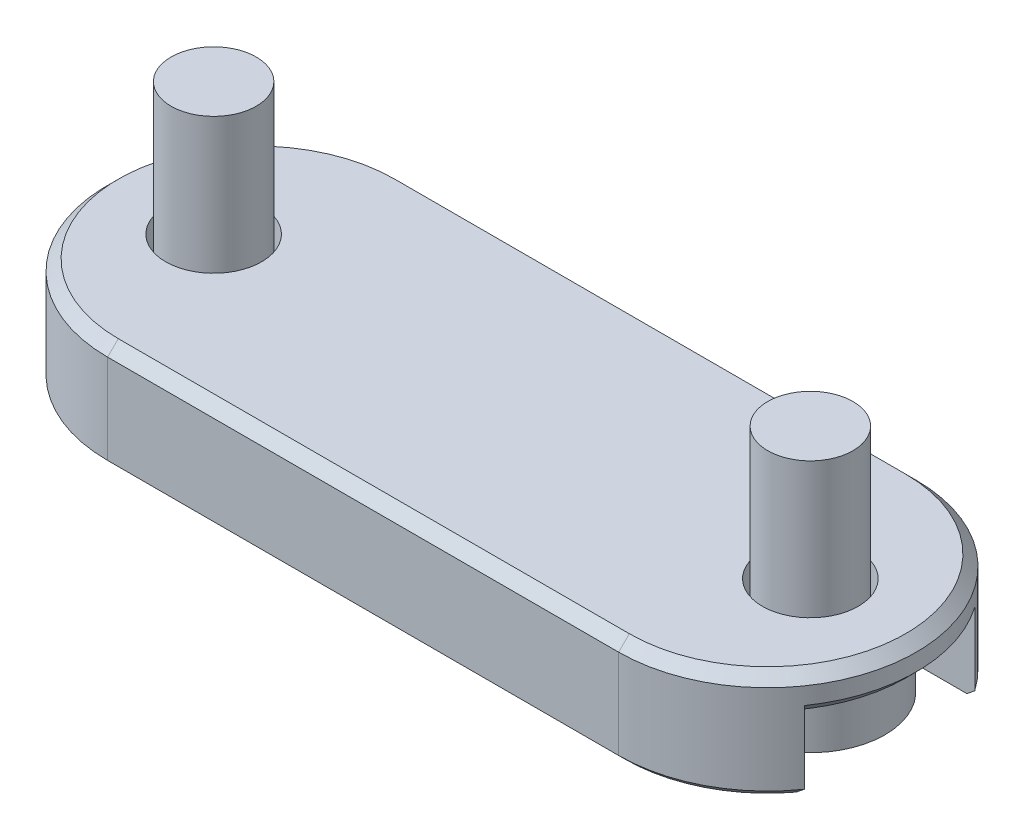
ISO-10303-21;
HEADER;
FILE_DESCRIPTION(('STEP AP214'),'2;1');
FILE_NAME('part.step','',(''),(''),'','','');
FILE_SCHEMA(('AUTOMOTIVE_DESIGN { 1 0 10303 214 1 1 1 1 }'));
ENDSEC;
DATA;
#1=APPLICATION_CONTEXT('core data for automotive mechanical design processes');
#2=APPLICATION_PROTOCOL_DEFINITION('international standard','automotive_design',2000,#1);
#3=PRODUCT_CONTEXT('',#1,'mechanical');
#4=PRODUCT('Part','Part','',(#3));
#5=PRODUCT_RELATED_PRODUCT_CATEGORY('part','',(#4));
#6=PRODUCT_DEFINITION_FORMATION('','',#4);
#7=PRODUCT_DEFINITION_CONTEXT('part definition',#1,'design');
#8=PRODUCT_DEFINITION('design','',#6,#7);
#9=PRODUCT_DEFINITION_SHAPE('','',#8);
#10=(LENGTH_UNIT() NAMED_UNIT(*) SI_UNIT(.MILLI.,.METRE.));
#11=(NAMED_UNIT(*) PLANE_ANGLE_UNIT() SI_UNIT($,.RADIAN.));
#12=(NAMED_UNIT(*) SI_UNIT($,.STERADIAN.) SOLID_ANGLE_UNIT());
#13=UNCERTAINTY_MEASURE_WITH_UNIT(LENGTH_MEASURE(1.E-05),#10,'distance_accuracy_value','');
#14=(GEOMETRIC_REPRESENTATION_CONTEXT(3) GLOBAL_UNCERTAINTY_ASSIGNED_CONTEXT((#13)) GLOBAL_UNIT_ASSIGNED_CONTEXT((#10,
#11,#12)) REPRESENTATION_CONTEXT('',''));
#15=CARTESIAN_POINT('',(0.,0.,0.));
#16=DIRECTION('',(0.,0.,1.));
#17=DIRECTION('',(1.,0.,0.));
#18=AXIS2_PLACEMENT_3D('',#15,#16,#17);
#19=CARTESIAN_POINT('',(-14.,11.2,0.));
#20=DIRECTION('',(0.,1.,0.));
#21=DIRECTION('',(-1.,0.,0.));
#22=AXIS2_PLACEMENT_3D('',#19,#20,#21);
#23=PLANE('',#22);
#24=CARTESIAN_POINT('',(-14.,11.2,0.));
#25=DIRECTION('',(0.,-1.,0.));
#26=DIRECTION('',(-1.,0.,0.));
#27=AXIS2_PLACEMENT_3D('',#24,#25,#26);
#28=CIRCLE('',#27,2.);
#29=CARTESIAN_POINT('',(-16.,11.2,0.));
#30=VERTEX_POINT('',#29);
#31=EDGE_CURVE('E12',#30,#30,#28,.T.);
#32=ORIENTED_EDGE('',*,*,#31,.F.);
#33=EDGE_LOOP('',(#32));
#34=FACE_BOUND('',#33,.T.);
#35=ADVANCED_FACE('F50',(#34),#23,.T.);
#36=CARTESIAN_POINT('',(-14.,11.2,0.));
#37=DIRECTION('',(0.,1.,0.));
#38=DIRECTION('',(-1.,0.,0.));
#39=AXIS2_PLACEMENT_3D('',#36,#37,#38);
#40=CYLINDRICAL_SURFACE('',#39,2.);
#41=CARTESIAN_POINT('',(-14.,3.2,0.));
#42=DIRECTION('',(0.,-1.,0.));
#43=DIRECTION('',(-1.,0.,0.));
#44=AXIS2_PLACEMENT_3D('',#41,#42,#43);
#45=CIRCLE('',#44,2.);
#46=CARTESIAN_POINT('',(-16.,3.2,0.));
#47=VERTEX_POINT('',#46);
#48=EDGE_CURVE('E57',#47,#47,#45,.T.);
#49=ORIENTED_EDGE('',*,*,#48,.F.);
#50=EDGE_LOOP('',(#49));
#51=FACE_BOUND('',#50,.T.);
#52=ORIENTED_EDGE('',*,*,#31,.T.);
#53=EDGE_LOOP('',(#52));
#54=FACE_BOUND('',#53,.T.);
#55=ADVANCED_FACE('F149',(#51,#54),#40,.T.);
#56=CARTESIAN_POINT('',(-14.,3.2,2.));
#57=DIRECTION('',(0.,1.,0.));
#58=DIRECTION('',(-1.,0.,0.));
#59=AXIS2_PLACEMENT_3D('',#56,#57,#58);
#60=PLANE('',#59);
#61=CARTESIAN_POINT('',(-14.,3.2,0.));
#62=DIRECTION('',(0.,-1.,0.));
#63=DIRECTION('',(-1.,0.,0.));
#64=AXIS2_PLACEMENT_3D('',#61,#62,#63);
#65=CIRCLE('',#64,3.5);
#66=CARTESIAN_POINT('',(-17.5,3.2,0.));
#67=VERTEX_POINT('',#66);
#68=EDGE_CURVE('E142',#67,#67,#65,.T.);
#69=ORIENTED_EDGE('',*,*,#68,.F.);
#70=EDGE_LOOP('',(#69));
#71=FACE_BOUND('',#70,.T.);
#72=ORIENTED_EDGE('',*,*,#48,.T.);
#73=EDGE_LOOP('',(#72));
#74=FACE_BOUND('',#73,.T.);
#75=ADVANCED_FACE('F147',(#71,#74),#60,.T.);
#76=CARTESIAN_POINT('',(-14.,11.2,0.));
#77=DIRECTION('',(0.,1.,0.));
#78=DIRECTION('',(-1.,0.,0.));
#79=AXIS2_PLACEMENT_3D('',#76,#77,#78);
#80=CYLINDRICAL_SURFACE('',#79,3.5);
#81=CARTESIAN_POINT('',(-14.,0.399999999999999,0.));
#82=DIRECTION('',(0.,-1.,0.));
#83=DIRECTION('',(-1.,0.,0.));
#84=AXIS2_PLACEMENT_3D('',#81,#82,#83);
#85=CIRCLE('',#84,3.5);
#86=CARTESIAN_POINT('',(-17.5,0.399999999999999,0.));
#87=VERTEX_POINT('',#86);
#88=EDGE_CURVE('E139',#87,#87,#85,.T.);
#89=ORIENTED_EDGE('',*,*,#88,.F.);
#90=EDGE_LOOP('',(#89));
#91=FACE_BOUND('',#90,.T.);
#92=ORIENTED_EDGE('',*,*,#68,.T.);
#93=EDGE_LOOP('',(#92));
#94=FACE_BOUND('',#93,.T.);
#95=ADVANCED_FACE('F167',(#91,#94),#80,.T.);
#96=CARTESIAN_POINT('',(-14.,0.399999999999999,3.5));
#97=DIRECTION('',(0.,-1.,0.));
#98=DIRECTION('',(1.,0.,0.));
#99=AXIS2_PLACEMENT_3D('',#96,#97,#98);
#100=PLANE('',#99);
#101=DIRECTION('',(-0.866025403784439,0.,0.5));
#102=VECTOR('',#101,1.);
#103=CARTESIAN_POINT('',(-14.,0.399999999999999,-1.44337567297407));
#104=LINE('',#103,#102);
#105=CARTESIAN_POINT('',(-14.,0.399999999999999,-1.44337567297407));
#106=VERTEX_POINT('',#105);
#107=CARTESIAN_POINT('',(-15.25,0.399999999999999,-0.721687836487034));
#108=VERTEX_POINT('',#107);
#109=EDGE_CURVE('E289',#106,#108,#104,.T.);
#110=ORIENTED_EDGE('',*,*,#109,.T.);
#111=DIRECTION('',(0.,0.,1.));
#112=VECTOR('',#111,1.);
#113=CARTESIAN_POINT('',(-15.25,0.399999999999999,-0.721687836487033));
#114=LINE('',#113,#112);
#115=CARTESIAN_POINT('',(-15.25,0.399999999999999,0.721687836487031));
#116=VERTEX_POINT('',#115);
#117=EDGE_CURVE('E283',#108,#116,#114,.T.);
#118=ORIENTED_EDGE('',*,*,#117,.T.);
#119=DIRECTION('',(0.866025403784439,0.,0.5));
#120=VECTOR('',#119,1.);
#121=CARTESIAN_POINT('',(-15.25,0.399999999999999,0.721687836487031));
#122=LINE('',#121,#120);
#123=CARTESIAN_POINT('',(-14.,0.399999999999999,1.44337567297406));
#124=VERTEX_POINT('',#123);
#125=EDGE_CURVE('E288',#116,#124,#122,.T.);
#126=ORIENTED_EDGE('',*,*,#125,.T.);
#127=DIRECTION('',(0.866025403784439,0.,-0.5));
#128=VECTOR('',#127,1.);
#129=CARTESIAN_POINT('',(-14.,0.399999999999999,1.44337567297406));
#130=LINE('',#129,#128);
#131=CARTESIAN_POINT('',(-12.75,0.399999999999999,0.721687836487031));
#132=VERTEX_POINT('',#131);
#133=EDGE_CURVE('E297',#124,#132,#130,.T.);
#134=ORIENTED_EDGE('',*,*,#133,.T.);
#135=DIRECTION('',(0.,0.,-1.));
#136=VECTOR('',#135,1.);
#137=CARTESIAN_POINT('',(-12.75,0.399999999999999,0.721687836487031));
#138=LINE('',#137,#136);
#139=CARTESIAN_POINT('',(-12.75,0.399999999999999,-0.721687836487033));
#140=VERTEX_POINT('',#139);
#141=EDGE_CURVE('E128',#132,#140,#138,.T.);
#142=ORIENTED_EDGE('',*,*,#141,.T.);
#143=DIRECTION('',(-0.866025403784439,0.,-0.5));
#144=VECTOR('',#143,1.);
#145=CARTESIAN_POINT('',(-12.75,0.399999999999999,-0.721687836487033));
#146=LINE('',#145,#144);
#147=EDGE_CURVE('E292',#140,#106,#146,.T.);
#148=ORIENTED_EDGE('',*,*,#147,.T.);
#149=EDGE_LOOP('',(#110,#118,#126,#134,#142,#148));
#150=FACE_BOUND('',#149,.T.);
#151=ORIENTED_EDGE('',*,*,#88,.T.);
#152=EDGE_LOOP('',(#151));
#153=FACE_BOUND('',#152,.T.);
#154=ADVANCED_FACE('F175',(#150,#153),#100,.T.);
#155=CARTESIAN_POINT('',(-14.,2.4,-1.44337567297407));
#156=DIRECTION('',(-0.5,0.,-0.866025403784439));
#157=DIRECTION('',(0.866025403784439,0.,-0.5));
#158=AXIS2_PLACEMENT_3D('',#155,#156,#157);
#159=PLANE('',#158);
#160=ORIENTED_EDGE('',*,*,#109,.F.);
#161=DIRECTION('',(0.,-1.,0.));
#162=VECTOR('',#161,1.);
#163=CARTESIAN_POINT('',(-14.,2.4,-1.44337567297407));
#164=LINE('',#163,#162);
#165=CARTESIAN_POINT('',(-14.,2.4,-1.44337567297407));
#166=VERTEX_POINT('',#165);
#167=EDGE_CURVE('E95',#166,#106,#164,.T.);
#168=ORIENTED_EDGE('',*,*,#167,.F.);
#169=DIRECTION('',(-0.866025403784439,0.,0.5));
#170=VECTOR('',#169,1.);
#171=CARTESIAN_POINT('',(-14.,2.4,-1.44337567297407));
#172=LINE('',#171,#170);
#173=CARTESIAN_POINT('',(-15.25,2.4,-0.721687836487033));
#174=VERTEX_POINT('',#173);
#175=EDGE_CURVE('E300',#166,#174,#172,.T.);
#176=ORIENTED_EDGE('',*,*,#175,.T.);
#177=DIRECTION('',(0.,-1.,0.));
#178=VECTOR('',#177,1.);
#179=CARTESIAN_POINT('',(-15.25,2.4,-0.721687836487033));
#180=LINE('',#179,#178);
#181=EDGE_CURVE('E64',#174,#108,#180,.T.);
#182=ORIENTED_EDGE('',*,*,#181,.T.);
#183=EDGE_LOOP('',(#160,#168,#176,#182));
#184=FACE_BOUND('',#183,.T.);
#185=ADVANCED_FACE('F183',(#184),#159,.F.);
#186=CARTESIAN_POINT('',(-12.75,2.4,-0.721687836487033));
#187=DIRECTION('',(0.5,0.,-0.866025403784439));
#188=DIRECTION('',(0.866025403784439,0.,0.5));
#189=AXIS2_PLACEMENT_3D('',#186,#187,#188);
#190=PLANE('',#189);
#191=ORIENTED_EDGE('',*,*,#147,.F.);
#192=DIRECTION('',(0.,-1.,0.));
#193=VECTOR('',#192,1.);
#194=CARTESIAN_POINT('',(-12.75,2.4,-0.721687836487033));
#195=LINE('',#194,#193);
#196=CARTESIAN_POINT('',(-12.75,2.4,-0.721687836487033));
#197=VERTEX_POINT('',#196);
#198=EDGE_CURVE('E130',#197,#140,#195,.T.);
#199=ORIENTED_EDGE('',*,*,#198,.F.);
#200=DIRECTION('',(-0.866025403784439,0.,-0.5));
#201=VECTOR('',#200,1.);
#202=CARTESIAN_POINT('',(-12.75,2.4,-0.721687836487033));
#203=LINE('',#202,#201);
#204=EDGE_CURVE('E73',#197,#166,#203,.T.);
#205=ORIENTED_EDGE('',*,*,#204,.T.);
#206=ORIENTED_EDGE('',*,*,#167,.T.);
#207=EDGE_LOOP('',(#191,#199,#205,#206));
#208=FACE_BOUND('',#207,.T.);
#209=ADVANCED_FACE('F191',(#208),#190,.F.);
#210=CARTESIAN_POINT('',(-12.75,2.4,0.721687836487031));
#211=DIRECTION('',(1.,0.,0.));
#212=DIRECTION('',(0.,1.,0.));
#213=AXIS2_PLACEMENT_3D('',#210,#211,#212);
#214=PLANE('',#213);
#215=ORIENTED_EDGE('',*,*,#141,.F.);
#216=DIRECTION('',(0.,-1.,0.));
#217=VECTOR('',#216,1.);
#218=CARTESIAN_POINT('',(-12.75,2.4,0.721687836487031));
#219=LINE('',#218,#217);
#220=CARTESIAN_POINT('',(-12.75,2.4,0.721687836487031));
#221=VERTEX_POINT('',#220);
#222=EDGE_CURVE('E117',#221,#132,#219,.T.);
#223=ORIENTED_EDGE('',*,*,#222,.F.);
#224=DIRECTION('',(0.,0.,-1.));
#225=VECTOR('',#224,1.);
#226=CARTESIAN_POINT('',(-12.75,2.4,0.721687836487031));
#227=LINE('',#226,#225);
#228=EDGE_CURVE('E120',#221,#197,#227,.T.);
#229=ORIENTED_EDGE('',*,*,#228,.T.);
#230=ORIENTED_EDGE('',*,*,#198,.T.);
#231=EDGE_LOOP('',(#215,#223,#229,#230));
#232=FACE_BOUND('',#231,.T.);
#233=ADVANCED_FACE('F126',(#232),#214,.F.);
#234=CARTESIAN_POINT('',(-14.,2.4,1.44337567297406));
#235=DIRECTION('',(0.5,0.,0.866025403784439));
#236=DIRECTION('',(-0.866025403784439,0.,0.5));
#237=AXIS2_PLACEMENT_3D('',#234,#235,#236);
#238=PLANE('',#237);
#239=ORIENTED_EDGE('',*,*,#133,.F.);
#240=DIRECTION('',(0.,-1.,0.));
#241=VECTOR('',#240,1.);
#242=CARTESIAN_POINT('',(-14.,2.4,1.44337567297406));
#243=LINE('',#242,#241);
#244=CARTESIAN_POINT('',(-14.,2.4,1.44337567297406));
#245=VERTEX_POINT('',#244);
#246=EDGE_CURVE('E119',#245,#124,#243,.T.);
#247=ORIENTED_EDGE('',*,*,#246,.F.);
#248=DIRECTION('',(0.866025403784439,0.,-0.5));
#249=VECTOR('',#248,1.);
#250=CARTESIAN_POINT('',(-14.,2.4,1.44337567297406));
#251=LINE('',#250,#249);
#252=EDGE_CURVE('E112',#245,#221,#251,.T.);
#253=ORIENTED_EDGE('',*,*,#252,.T.);
#254=ORIENTED_EDGE('',*,*,#222,.T.);
#255=EDGE_LOOP('',(#239,#247,#253,#254));
#256=FACE_BOUND('',#255,.T.);
#257=ADVANCED_FACE('F115',(#256),#238,.F.);
#258=CARTESIAN_POINT('',(-15.25,2.4,0.721687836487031));
#259=DIRECTION('',(-0.5,0.,0.866025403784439));
#260=DIRECTION('',(-0.866025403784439,0.,-0.5));
#261=AXIS2_PLACEMENT_3D('',#258,#259,#260);
#262=PLANE('',#261);
#263=ORIENTED_EDGE('',*,*,#125,.F.);
#264=DIRECTION('',(0.,-1.,0.));
#265=VECTOR('',#264,1.);
#266=CARTESIAN_POINT('',(-15.25,2.4,0.721687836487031));
#267=LINE('',#266,#265);
#268=CARTESIAN_POINT('',(-15.25,2.4,0.721687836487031));
#269=VERTEX_POINT('',#268);
#270=EDGE_CURVE('E133',#269,#116,#267,.T.);
#271=ORIENTED_EDGE('',*,*,#270,.F.);
#272=DIRECTION('',(0.866025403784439,0.,0.5));
#273=VECTOR('',#272,1.);
#274=CARTESIAN_POINT('',(-15.25,2.4,0.721687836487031));
#275=LINE('',#274,#273);
#276=EDGE_CURVE('E121',#269,#245,#275,.T.);
#277=ORIENTED_EDGE('',*,*,#276,.T.);
#278=ORIENTED_EDGE('',*,*,#246,.T.);
#279=EDGE_LOOP('',(#263,#271,#277,#278));
#280=FACE_BOUND('',#279,.T.);
#281=ADVANCED_FACE('F210',(#280),#262,.F.);
#282=CARTESIAN_POINT('',(-15.25,2.4,-0.721687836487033));
#283=DIRECTION('',(-1.,0.,0.));
#284=DIRECTION('',(0.,-1.,0.));
#285=AXIS2_PLACEMENT_3D('',#282,#283,#284);
#286=PLANE('',#285);
#287=ORIENTED_EDGE('',*,*,#117,.F.);
#288=ORIENTED_EDGE('',*,*,#181,.F.);
#289=DIRECTION('',(0.,0.,1.));
#290=VECTOR('',#289,1.);
#291=CARTESIAN_POINT('',(-15.25,2.4,-0.721687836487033));
#292=LINE('',#291,#290);
#293=EDGE_CURVE('E103',#174,#269,#292,.T.);
#294=ORIENTED_EDGE('',*,*,#293,.T.);
#295=ORIENTED_EDGE('',*,*,#270,.T.);
#296=EDGE_LOOP('',(#287,#288,#294,#295));
#297=FACE_BOUND('',#296,.T.);
#298=ADVANCED_FACE('F217',(#297),#286,.F.);
#299=CARTESIAN_POINT('',(-14.,2.4,-1.44337567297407));
#300=DIRECTION('',(0.,1.,0.));
#301=DIRECTION('',(-1.,0.,0.));
#302=AXIS2_PLACEMENT_3D('',#299,#300,#301);
#303=PLANE('',#302);
#304=ORIENTED_EDGE('',*,*,#175,.F.);
#305=ORIENTED_EDGE('',*,*,#204,.F.);
#306=ORIENTED_EDGE('',*,*,#228,.F.);
#307=ORIENTED_EDGE('',*,*,#252,.F.);
#308=ORIENTED_EDGE('',*,*,#276,.F.);
#309=ORIENTED_EDGE('',*,*,#293,.F.);
#310=EDGE_LOOP('',(#304,#305,#306,#307,#308,#309));
#311=FACE_BOUND('',#310,.T.);
#312=ADVANCED_FACE('F123',(#311),#303,.F.);
#313=CLOSED_SHELL('',(#35,#55,#75,#95,#154,#185,#209,#233,#257,#281,#298,#312));
#314=MANIFOLD_SOLID_BREP('B2',#313);
#315=CARTESIAN_POINT('',(14.,11.2,0.));
#316=DIRECTION('',(0.,1.,0.));
#317=DIRECTION('',(1.,0.,0.));
#318=AXIS2_PLACEMENT_3D('',#315,#316,#317);
#319=PLANE('',#318);
#320=CARTESIAN_POINT('',(14.,11.2,0.));
#321=DIRECTION('',(0.,1.,0.));
#322=DIRECTION('',(1.,0.,0.));
#323=AXIS2_PLACEMENT_3D('',#320,#321,#322);
#324=CIRCLE('',#323,2.);
#325=CARTESIAN_POINT('',(16.,11.2,0.));
#326=VERTEX_POINT('',#325);
#327=EDGE_CURVE('E48',#326,#326,#324,.T.);
#328=ORIENTED_EDGE('',*,*,#327,.T.);
#329=EDGE_LOOP('',(#328));
#330=FACE_BOUND('',#329,.T.);
#331=ADVANCED_FACE('F319',(#330),#319,.T.);
#332=CARTESIAN_POINT('',(14.,11.2,0.));
#333=DIRECTION('',(0.,1.,0.));
#334=DIRECTION('',(1.,0.,0.));
#335=AXIS2_PLACEMENT_3D('',#332,#333,#334);
#336=CYLINDRICAL_SURFACE('',#335,2.);
#337=CARTESIAN_POINT('',(14.,3.2,0.));
#338=DIRECTION('',(0.,1.,0.));
#339=DIRECTION('',(1.,0.,0.));
#340=AXIS2_PLACEMENT_3D('',#337,#338,#339);
#341=CIRCLE('',#340,2.);
#342=CARTESIAN_POINT('',(16.,3.2,0.));
#343=VERTEX_POINT('',#342);
#344=EDGE_CURVE('E326',#343,#343,#341,.T.);
#345=ORIENTED_EDGE('',*,*,#344,.T.);
#346=EDGE_LOOP('',(#345));
#347=FACE_BOUND('',#346,.T.);
#348=ORIENTED_EDGE('',*,*,#327,.F.);
#349=EDGE_LOOP('',(#348));
#350=FACE_BOUND('',#349,.T.);
#351=ADVANCED_FACE('F433',(#347,#350),#336,.T.);
#352=CARTESIAN_POINT('',(14.,3.2,2.));
#353=DIRECTION('',(0.,1.,0.));
#354=DIRECTION('',(1.,0.,0.));
#355=AXIS2_PLACEMENT_3D('',#352,#353,#354);
#356=PLANE('',#355);
#357=CARTESIAN_POINT('',(14.,3.2,0.));
#358=DIRECTION('',(0.,1.,0.));
#359=DIRECTION('',(1.,0.,0.));
#360=AXIS2_PLACEMENT_3D('',#357,#358,#359);
#361=CIRCLE('',#360,3.5);
#362=CARTESIAN_POINT('',(17.5,3.2,0.));
#363=VERTEX_POINT('',#362);
#364=EDGE_CURVE('E428',#363,#363,#361,.T.);
#365=ORIENTED_EDGE('',*,*,#364,.T.);
#366=EDGE_LOOP('',(#365));
#367=FACE_BOUND('',#366,.T.);
#368=ORIENTED_EDGE('',*,*,#344,.F.);
#369=EDGE_LOOP('',(#368));
#370=FACE_BOUND('',#369,.T.);
#371=ADVANCED_FACE('F436',(#367,#370),#356,.T.);
#372=CARTESIAN_POINT('',(14.,11.2,0.));
#373=DIRECTION('',(0.,1.,0.));
#374=DIRECTION('',(1.,0.,0.));
#375=AXIS2_PLACEMENT_3D('',#372,#373,#374);
#376=CYLINDRICAL_SURFACE('',#375,3.5);
#377=CARTESIAN_POINT('',(14.,0.399999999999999,0.));
#378=DIRECTION('',(0.,1.,0.));
#379=DIRECTION('',(1.,0.,0.));
#380=AXIS2_PLACEMENT_3D('',#377,#378,#379);
#381=CIRCLE('',#380,3.5);
#382=CARTESIAN_POINT('',(17.5,0.399999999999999,0.));
#383=VERTEX_POINT('',#382);
#384=EDGE_CURVE('E420',#383,#383,#381,.T.);
#385=ORIENTED_EDGE('',*,*,#384,.T.);
#386=EDGE_LOOP('',(#385));
#387=FACE_BOUND('',#386,.T.);
#388=ORIENTED_EDGE('',*,*,#364,.F.);
#389=EDGE_LOOP('',(#388));
#390=FACE_BOUND('',#389,.T.);
#391=ADVANCED_FACE('F438',(#387,#390),#376,.T.);
#392=CARTESIAN_POINT('',(14.,0.399999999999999,3.5));
#393=DIRECTION('',(0.,-1.,0.));
#394=DIRECTION('',(-1.,0.,0.));
#395=AXIS2_PLACEMENT_3D('',#392,#393,#394);
#396=PLANE('',#395);
#397=DIRECTION('',(0.866025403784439,0.,0.5));
#398=VECTOR('',#397,1.);
#399=CARTESIAN_POINT('',(14.,0.399999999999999,-1.44337567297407));
#400=LINE('',#399,#398);
#401=CARTESIAN_POINT('',(14.,0.399999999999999,-1.44337567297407));
#402=VERTEX_POINT('',#401);
#403=CARTESIAN_POINT('',(15.25,0.399999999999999,-0.721687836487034));
#404=VERTEX_POINT('',#403);
#405=EDGE_CURVE('E333',#402,#404,#400,.T.);
#406=ORIENTED_EDGE('',*,*,#405,.F.);
#407=DIRECTION('',(0.866025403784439,0.,-0.5));
#408=VECTOR('',#407,1.);
#409=CARTESIAN_POINT('',(12.75,0.399999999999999,-0.721687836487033));
#410=LINE('',#409,#408);
#411=CARTESIAN_POINT('',(12.75,0.399999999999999,-0.721687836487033));
#412=VERTEX_POINT('',#411);
#413=EDGE_CURVE('E416',#412,#402,#410,.T.);
#414=ORIENTED_EDGE('',*,*,#413,.F.);
#415=DIRECTION('',(0.,0.,-1.));
#416=VECTOR('',#415,1.);
#417=CARTESIAN_POINT('',(12.75,0.399999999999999,0.721687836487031));
#418=LINE('',#417,#416);
#419=CARTESIAN_POINT('',(12.75,0.399999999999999,0.721687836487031));
#420=VERTEX_POINT('',#419);
#421=EDGE_CURVE('E414',#420,#412,#418,.T.);
#422=ORIENTED_EDGE('',*,*,#421,.F.);
#423=DIRECTION('',(-0.866025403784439,0.,-0.5));
#424=VECTOR('',#423,1.);
#425=CARTESIAN_POINT('',(14.,0.399999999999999,1.44337567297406));
#426=LINE('',#425,#424);
#427=CARTESIAN_POINT('',(14.,0.399999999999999,1.44337567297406));
#428=VERTEX_POINT('',#427);
#429=EDGE_CURVE('E381',#428,#420,#426,.T.);
#430=ORIENTED_EDGE('',*,*,#429,.F.);
#431=DIRECTION('',(-0.866025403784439,0.,0.5));
#432=VECTOR('',#431,1.);
#433=CARTESIAN_POINT('',(15.25,0.399999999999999,0.721687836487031));
#434=LINE('',#433,#432);
#435=CARTESIAN_POINT('',(15.25,0.399999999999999,0.721687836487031));
#436=VERTEX_POINT('',#435);
#437=EDGE_CURVE('E410',#436,#428,#434,.T.);
#438=ORIENTED_EDGE('',*,*,#437,.F.);
#439=DIRECTION('',(0.,0.,1.));
#440=VECTOR('',#439,1.);
#441=CARTESIAN_POINT('',(15.25,0.399999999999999,-0.721687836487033));
#442=LINE('',#441,#440);
#443=EDGE_CURVE('E407',#404,#436,#442,.T.);
#444=ORIENTED_EDGE('',*,*,#443,.F.);
#445=EDGE_LOOP('',(#406,#414,#422,#430,#438,#444));
#446=FACE_BOUND('',#445,.T.);
#447=ORIENTED_EDGE('',*,*,#384,.F.);
#448=EDGE_LOOP('',(#447));
#449=FACE_BOUND('',#448,.T.);
#450=ADVANCED_FACE('F445',(#446,#449),#396,.T.);
#451=CARTESIAN_POINT('',(14.,2.4,-1.44337567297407));
#452=DIRECTION('',(0.5,0.,-0.866025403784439));
#453=DIRECTION('',(-0.866025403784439,0.,-0.5));
#454=AXIS2_PLACEMENT_3D('',#451,#452,#453);
#455=PLANE('',#454);
#456=ORIENTED_EDGE('',*,*,#405,.T.);
#457=DIRECTION('',(0.,-1.,0.));
#458=VECTOR('',#457,1.);
#459=CARTESIAN_POINT('',(15.25,2.4,-0.721687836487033));
#460=LINE('',#459,#458);
#461=CARTESIAN_POINT('',(15.25,2.4,-0.721687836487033));
#462=VERTEX_POINT('',#461);
#463=EDGE_CURVE('E363',#462,#404,#460,.T.);
#464=ORIENTED_EDGE('',*,*,#463,.F.);
#465=DIRECTION('',(0.866025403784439,0.,0.5));
#466=VECTOR('',#465,1.);
#467=CARTESIAN_POINT('',(14.,2.4,-1.44337567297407));
#468=LINE('',#467,#466);
#469=CARTESIAN_POINT('',(14.,2.4,-1.44337567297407));
#470=VERTEX_POINT('',#469);
#471=EDGE_CURVE('E418',#470,#462,#468,.T.);
#472=ORIENTED_EDGE('',*,*,#471,.F.);
#473=DIRECTION('',(0.,-1.,0.));
#474=VECTOR('',#473,1.);
#475=CARTESIAN_POINT('',(14.,2.4,-1.44337567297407));
#476=LINE('',#475,#474);
#477=EDGE_CURVE('E341',#470,#402,#476,.T.);
#478=ORIENTED_EDGE('',*,*,#477,.T.);
#479=EDGE_LOOP('',(#456,#464,#472,#478));
#480=FACE_BOUND('',#479,.T.);
#481=ADVANCED_FACE('F476',(#480),#455,.F.);
#482=CARTESIAN_POINT('',(12.75,2.4,-0.721687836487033));
#483=DIRECTION('',(-0.5,0.,-0.866025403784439));
#484=DIRECTION('',(-0.866025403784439,0.,0.5));
#485=AXIS2_PLACEMENT_3D('',#482,#483,#484);
#486=PLANE('',#485);
#487=ORIENTED_EDGE('',*,*,#413,.T.);
#488=ORIENTED_EDGE('',*,*,#477,.F.);
#489=DIRECTION('',(0.866025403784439,0.,-0.5));
#490=VECTOR('',#489,1.);
#491=CARTESIAN_POINT('',(12.75,2.4,-0.721687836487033));
#492=LINE('',#491,#490);
#493=CARTESIAN_POINT('',(12.75,2.4,-0.721687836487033));
#494=VERTEX_POINT('',#493);
#495=EDGE_CURVE('E393',#494,#470,#492,.T.);
#496=ORIENTED_EDGE('',*,*,#495,.F.);
#497=DIRECTION('',(0.,-1.,0.));
#498=VECTOR('',#497,1.);
#499=CARTESIAN_POINT('',(12.75,2.4,-0.721687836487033));
#500=LINE('',#499,#498);
#501=EDGE_CURVE('E385',#494,#412,#500,.T.);
#502=ORIENTED_EDGE('',*,*,#501,.T.);
#503=EDGE_LOOP('',(#487,#488,#496,#502));
#504=FACE_BOUND('',#503,.T.);
#505=ADVANCED_FACE('F486',(#504),#486,.F.);
#506=CARTESIAN_POINT('',(12.75,2.4,0.721687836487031));
#507=DIRECTION('',(-1.,0.,0.));
#508=DIRECTION('',(0.,1.,0.));
#509=AXIS2_PLACEMENT_3D('',#506,#507,#508);
#510=PLANE('',#509);
#511=ORIENTED_EDGE('',*,*,#421,.T.);
#512=ORIENTED_EDGE('',*,*,#501,.F.);
#513=DIRECTION('',(0.,0.,-1.));
#514=VECTOR('',#513,1.);
#515=CARTESIAN_POINT('',(12.75,2.4,0.721687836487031));
#516=LINE('',#515,#514);
#517=CARTESIAN_POINT('',(12.75,2.4,0.721687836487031));
#518=VERTEX_POINT('',#517);
#519=EDGE_CURVE('E389',#518,#494,#516,.T.);
#520=ORIENTED_EDGE('',*,*,#519,.F.);
#521=DIRECTION('',(0.,-1.,0.));
#522=VECTOR('',#521,1.);
#523=CARTESIAN_POINT('',(12.75,2.4,0.721687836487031));
#524=LINE('',#523,#522);
#525=EDGE_CURVE('E374',#518,#420,#524,.T.);
#526=ORIENTED_EDGE('',*,*,#525,.T.);
#527=EDGE_LOOP('',(#511,#512,#520,#526));
#528=FACE_BOUND('',#527,.T.);
#529=ADVANCED_FACE('F390',(#528),#510,.F.);
#530=CARTESIAN_POINT('',(14.,2.4,1.44337567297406));
#531=DIRECTION('',(-0.5,0.,0.866025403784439));
#532=DIRECTION('',(0.866025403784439,0.,0.5));
#533=AXIS2_PLACEMENT_3D('',#530,#531,#532);
#534=PLANE('',#533);
#535=ORIENTED_EDGE('',*,*,#429,.T.);
#536=ORIENTED_EDGE('',*,*,#525,.F.);
#537=DIRECTION('',(-0.866025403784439,0.,-0.5));
#538=VECTOR('',#537,1.);
#539=CARTESIAN_POINT('',(14.,2.4,1.44337567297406));
#540=LINE('',#539,#538);
#541=CARTESIAN_POINT('',(14.,2.4,1.44337567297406));
#542=VERTEX_POINT('',#541);
#543=EDGE_CURVE('E378',#542,#518,#540,.T.);
#544=ORIENTED_EDGE('',*,*,#543,.F.);
#545=DIRECTION('',(0.,-1.,0.));
#546=VECTOR('',#545,1.);
#547=CARTESIAN_POINT('',(14.,2.4,1.44337567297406));
#548=LINE('',#547,#546);
#549=EDGE_CURVE('E386',#542,#428,#548,.T.);
#550=ORIENTED_EDGE('',*,*,#549,.T.);
#551=EDGE_LOOP('',(#535,#536,#544,#550));
#552=FACE_BOUND('',#551,.T.);
#553=ADVANCED_FACE('F376',(#552),#534,.F.);
#554=CARTESIAN_POINT('',(15.25,2.4,0.721687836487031));
#555=DIRECTION('',(0.5,0.,0.866025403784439));
#556=DIRECTION('',(0.866025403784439,0.,-0.5));
#557=AXIS2_PLACEMENT_3D('',#554,#555,#556);
#558=PLANE('',#557);
#559=ORIENTED_EDGE('',*,*,#437,.T.);
#560=ORIENTED_EDGE('',*,*,#549,.F.);
#561=DIRECTION('',(-0.866025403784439,0.,0.5));
#562=VECTOR('',#561,1.);
#563=CARTESIAN_POINT('',(15.25,2.4,0.721687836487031));
#564=LINE('',#563,#562);
#565=CARTESIAN_POINT('',(15.25,2.4,0.721687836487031));
#566=VERTEX_POINT('',#565);
#567=EDGE_CURVE('E399',#566,#542,#564,.T.);
#568=ORIENTED_EDGE('',*,*,#567,.F.);
#569=DIRECTION('',(0.,-1.,0.));
#570=VECTOR('',#569,1.);
#571=CARTESIAN_POINT('',(15.25,2.4,0.721687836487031));
#572=LINE('',#571,#570);
#573=EDGE_CURVE('E423',#566,#436,#572,.T.);
#574=ORIENTED_EDGE('',*,*,#573,.T.);
#575=EDGE_LOOP('',(#559,#560,#568,#574));
#576=FACE_BOUND('',#575,.T.);
#577=ADVANCED_FACE('F511',(#576),#558,.F.);
#578=CARTESIAN_POINT('',(15.25,2.4,-0.721687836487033));
#579=DIRECTION('',(1.,0.,0.));
#580=DIRECTION('',(0.,-1.,0.));
#581=AXIS2_PLACEMENT_3D('',#578,#579,#580);
#582=PLANE('',#581);
#583=ORIENTED_EDGE('',*,*,#443,.T.);
#584=ORIENTED_EDGE('',*,*,#573,.F.);
#585=DIRECTION('',(0.,0.,1.));
#586=VECTOR('',#585,1.);
#587=CARTESIAN_POINT('',(15.25,2.4,-0.721687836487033));
#588=LINE('',#587,#586);
#589=EDGE_CURVE('E401',#462,#566,#588,.T.);
#590=ORIENTED_EDGE('',*,*,#589,.F.);
#591=ORIENTED_EDGE('',*,*,#463,.T.);
#592=EDGE_LOOP('',(#583,#584,#590,#591));
#593=FACE_BOUND('',#592,.T.);
#594=ADVANCED_FACE('F520',(#593),#582,.F.);
#595=CARTESIAN_POINT('',(14.,2.4,-1.44337567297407));
#596=DIRECTION('',(0.,1.,0.));
#597=DIRECTION('',(1.,0.,0.));
#598=AXIS2_PLACEMENT_3D('',#595,#596,#597);
#599=PLANE('',#598);
#600=ORIENTED_EDGE('',*,*,#471,.T.);
#601=ORIENTED_EDGE('',*,*,#589,.T.);
#602=ORIENTED_EDGE('',*,*,#567,.T.);
#603=ORIENTED_EDGE('',*,*,#543,.T.);
#604=ORIENTED_EDGE('',*,*,#519,.T.);
#605=ORIENTED_EDGE('',*,*,#495,.T.);
#606=EDGE_LOOP('',(#600,#601,#602,#603,#604,#605));
#607=FACE_BOUND('',#606,.T.);
#608=ADVANCED_FACE('F396',(#607),#599,.F.);
#609=CLOSED_SHELL('',(#331,#351,#371,#391,#450,#481,#505,#529,#553,#577,#594,#608));
#610=MANIFOLD_SOLID_BREP('B6',#609);
#611=CARTESIAN_POINT('',(-11.99,0.,0.));
#612=DIRECTION('',(0.,1.,0.));
#613=DIRECTION('',(0.,0.,1.));
#614=AXIS2_PLACEMENT_3D('',#611,#612,#613);
#615=PLANE('',#614);
#616=DIRECTION('',(1.,0.,0.));
#617=VECTOR('',#616,1.);
#618=CARTESIAN_POINT('',(-11.99,0.,-6.685));
#619=LINE('',#618,#617);
#620=CARTESIAN_POINT('',(-11.99,0.,-6.685));
#621=VERTEX_POINT('',#620);
#622=CARTESIAN_POINT('',(11.99,0.,-6.685));
#623=VERTEX_POINT('',#622);
#624=EDGE_CURVE('E1210',#621,#623,#619,.T.);
#625=ORIENTED_EDGE('',*,*,#624,.T.);
#626=CARTESIAN_POINT('',(11.99,0.,0.));
#627=DIRECTION('',(0.,1.,0.));
#628=DIRECTION('',(0.,0.,1.));
#629=AXIS2_PLACEMENT_3D('',#626,#627,#628);
#630=CIRCLE('',#629,6.685);
#631=CARTESIAN_POINT('',(17.3462323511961,0.,-4.));
#632=VERTEX_POINT('',#631);
#633=EDGE_CURVE('E1027',#623,#632,#630,.F.);
#634=ORIENTED_EDGE('',*,*,#633,.T.);
#635=DIRECTION('',(-1.,0.,0.));
#636=VECTOR('',#635,1.);
#637=CARTESIAN_POINT('',(14.,0.,-4.));
#638=LINE('',#637,#636);
#639=CARTESIAN_POINT('',(14.,0.,-4.));
#640=VERTEX_POINT('',#639);
#641=EDGE_CURVE('E771',#632,#640,#638,.T.);
#642=ORIENTED_EDGE('',*,*,#641,.T.);
#643=CARTESIAN_POINT('',(14.,0.,0.));
#644=DIRECTION('',(0.,1.,0.));
#645=DIRECTION('',(0.,0.,1.));
#646=AXIS2_PLACEMENT_3D('',#643,#644,#645);
#647=CIRCLE('',#646,4.);
#648=CARTESIAN_POINT('',(11.4756274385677,0.,-3.10282825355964));
#649=VERTEX_POINT('',#648);
#650=EDGE_CURVE('E1223',#640,#649,#647,.T.);
#651=ORIENTED_EDGE('',*,*,#650,.T.);
#652=DIRECTION('',(-1.,0.,0.));
#653=VECTOR('',#652,1.);
#654=CARTESIAN_POINT('',(-11.99,0.,-3.10282825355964));
#655=LINE('',#654,#653);
#656=CARTESIAN_POINT('',(-11.4756274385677,0.,-3.10282825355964));
#657=VERTEX_POINT('',#656);
#658=EDGE_CURVE('E960',#649,#657,#655,.T.);
#659=ORIENTED_EDGE('',*,*,#658,.T.);
#660=CARTESIAN_POINT('',(-14.,0.,0.));
#661=DIRECTION('',(0.,1.,0.));
#662=DIRECTION('',(0.,0.,1.));
#663=AXIS2_PLACEMENT_3D('',#660,#661,#662);
#664=CIRCLE('',#663,4.);
#665=CARTESIAN_POINT('',(-14.,0.,-4.));
#666=VERTEX_POINT('',#665);
#667=EDGE_CURVE('E796',#657,#666,#664,.T.);
#668=ORIENTED_EDGE('',*,*,#667,.T.);
#669=DIRECTION('',(-1.,0.,0.));
#670=VECTOR('',#669,1.);
#671=CARTESIAN_POINT('',(-20.,0.,-4.));
#672=LINE('',#671,#670);
#673=CARTESIAN_POINT('',(-17.3462323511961,0.,-4.));
#674=VERTEX_POINT('',#673);
#675=EDGE_CURVE('E788',#666,#674,#672,.T.);
#676=ORIENTED_EDGE('',*,*,#675,.T.);
#677=CARTESIAN_POINT('',(-11.99,0.,0.));
#678=DIRECTION('',(0.,1.,0.));
#679=DIRECTION('',(0.,0.,1.));
#680=AXIS2_PLACEMENT_3D('',#677,#678,#679);
#681=CIRCLE('',#680,6.685);
#682=EDGE_CURVE('E1207',#674,#621,#681,.F.);
#683=ORIENTED_EDGE('',*,*,#682,.T.);
#684=EDGE_LOOP('',(#625,#634,#642,#651,#659,#668,#676,#683));
#685=FACE_BOUND('',#684,.T.);
#686=ADVANCED_FACE('F579',(#685),#615,.F.);
#687=CARTESIAN_POINT('',(-11.99,5.,0.));
#688=DIRECTION('',(0.,-1.,0.));
#689=DIRECTION('',(0.,0.,-1.));
#690=AXIS2_PLACEMENT_3D('',#687,#688,#689);
#691=CYLINDRICAL_SURFACE('',#690,6.985);
#692=DIRECTION('',(0.,-1.,0.));
#693=VECTOR('',#692,1.);
#694=CARTESIAN_POINT('',(-11.99,5.,6.985));
#695=LINE('',#694,#693);
#696=CARTESIAN_POINT('',(-11.99,4.5,6.985));
#697=VERTEX_POINT('',#696);
#698=CARTESIAN_POINT('',(-11.99,0.299999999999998,6.985));
#699=VERTEX_POINT('',#698);
#700=EDGE_CURVE('E915',#697,#699,#695,.T.);
#701=ORIENTED_EDGE('',*,*,#700,.F.);
#702=CARTESIAN_POINT('',(-11.99,4.5,0.));
#703=DIRECTION('',(0.,1.,0.));
#704=DIRECTION('',(0.,0.,1.));
#705=AXIS2_PLACEMENT_3D('',#702,#703,#704);
#706=CIRCLE('',#705,6.985);
#707=CARTESIAN_POINT('',(-11.99,4.5,-6.985));
#708=VERTEX_POINT('',#707);
#709=EDGE_CURVE('E1100',#697,#708,#706,.F.);
#710=ORIENTED_EDGE('',*,*,#709,.T.);
#711=DIRECTION('',(0.,-1.,0.));
#712=VECTOR('',#711,1.);
#713=CARTESIAN_POINT('',(-11.99,5.,-6.985));
#714=LINE('',#713,#712);
#715=CARTESIAN_POINT('',(-11.99,0.299999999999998,-6.985));
#716=VERTEX_POINT('',#715);
#717=EDGE_CURVE('E909',#708,#716,#714,.T.);
#718=ORIENTED_EDGE('',*,*,#717,.T.);
#719=CARTESIAN_POINT('',(-11.99,0.299999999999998,0.));
#720=DIRECTION('',(0.,1.,0.));
#721=DIRECTION('',(0.,0.,1.));
#722=AXIS2_PLACEMENT_3D('',#719,#720,#721);
#723=CIRCLE('',#722,6.985);
#724=CARTESIAN_POINT('',(-17.7162749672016,0.299999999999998,-4.));
#725=VERTEX_POINT('',#724);
#726=EDGE_CURVE('E963',#716,#725,#723,.T.);
#727=ORIENTED_EDGE('',*,*,#726,.T.);
#728=DIRECTION('',(0.,-1.,0.));
#729=VECTOR('',#728,1.);
#730=CARTESIAN_POINT('',(-17.7162749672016,5.,-4.));
#731=LINE('',#730,#729);
#732=CARTESIAN_POINT('',(-17.7162749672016,3.7,-4.));
#733=VERTEX_POINT('',#732);
#734=EDGE_CURVE('E930',#733,#725,#731,.T.);
#735=ORIENTED_EDGE('',*,*,#734,.F.);
#736=CARTESIAN_POINT('',(-11.99,3.7,0.));
#737=DIRECTION('',(0.,1.,0.));
#738=DIRECTION('',(0.,0.,1.));
#739=AXIS2_PLACEMENT_3D('',#736,#737,#738);
#740=CIRCLE('',#739,6.985);
#741=CARTESIAN_POINT('',(-17.7162749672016,3.7,4.));
#742=VERTEX_POINT('',#741);
#743=EDGE_CURVE('E1097',#733,#742,#740,.T.);
#744=ORIENTED_EDGE('',*,*,#743,.T.);
#745=DIRECTION('',(0.,-1.,0.));
#746=VECTOR('',#745,1.);
#747=CARTESIAN_POINT('',(-17.7162749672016,5.,4.));
#748=LINE('',#747,#746);
#749=CARTESIAN_POINT('',(-17.7162749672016,0.299999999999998,4.));
#750=VERTEX_POINT('',#749);
#751=EDGE_CURVE('E932',#750,#742,#748,.F.);
#752=ORIENTED_EDGE('',*,*,#751,.F.);
#753=CARTESIAN_POINT('',(-11.99,0.299999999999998,0.));
#754=DIRECTION('',(0.,1.,0.));
#755=DIRECTION('',(0.,0.,1.));
#756=AXIS2_PLACEMENT_3D('',#753,#754,#755);
#757=CIRCLE('',#756,6.985);
#758=EDGE_CURVE('E967',#750,#699,#757,.T.);
#759=ORIENTED_EDGE('',*,*,#758,.T.);
#760=EDGE_LOOP('',(#701,#710,#718,#727,#735,#744,#752,#759));
#761=FACE_BOUND('',#760,.T.);
#762=ADVANCED_FACE('F1163',(#761),#691,.T.);
#763=CARTESIAN_POINT('',(11.99,5.,0.));
#764=DIRECTION('',(0.,-1.,0.));
#765=DIRECTION('',(0.,0.,-1.));
#766=AXIS2_PLACEMENT_3D('',#763,#764,#765);
#767=CYLINDRICAL_SURFACE('',#766,6.985);
#768=DIRECTION('',(0.,-1.,0.));
#769=VECTOR('',#768,1.);
#770=CARTESIAN_POINT('',(11.99,5.,-6.985));
#771=LINE('',#770,#769);
#772=CARTESIAN_POINT('',(11.99,4.5,-6.985));
#773=VERTEX_POINT('',#772);
#774=CARTESIAN_POINT('',(11.99,0.299999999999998,-6.985));
#775=VERTEX_POINT('',#774);
#776=EDGE_CURVE('E911',#773,#775,#771,.T.);
#777=ORIENTED_EDGE('',*,*,#776,.F.);
#778=CARTESIAN_POINT('',(11.99,4.5,0.));
#779=DIRECTION('',(0.,1.,0.));
#780=DIRECTION('',(0.,0.,1.));
#781=AXIS2_PLACEMENT_3D('',#778,#779,#780);
#782=CIRCLE('',#781,6.985);
#783=CARTESIAN_POINT('',(11.99,4.5,6.985));
#784=VERTEX_POINT('',#783);
#785=EDGE_CURVE('E1105',#773,#784,#782,.F.);
#786=ORIENTED_EDGE('',*,*,#785,.T.);
#787=DIRECTION('',(0.,-1.,0.));
#788=VECTOR('',#787,1.);
#789=CARTESIAN_POINT('',(11.99,5.,6.985));
#790=LINE('',#789,#788);
#791=CARTESIAN_POINT('',(11.99,0.299999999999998,6.985));
#792=VERTEX_POINT('',#791);
#793=EDGE_CURVE('E913',#784,#792,#790,.T.);
#794=ORIENTED_EDGE('',*,*,#793,.T.);
#795=CARTESIAN_POINT('',(11.99,0.299999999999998,0.));
#796=DIRECTION('',(0.,1.,0.));
#797=DIRECTION('',(0.,0.,1.));
#798=AXIS2_PLACEMENT_3D('',#795,#796,#797);
#799=CIRCLE('',#798,6.985);
#800=CARTESIAN_POINT('',(17.7162749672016,0.299999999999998,4.));
#801=VERTEX_POINT('',#800);
#802=EDGE_CURVE('E985',#792,#801,#799,.T.);
#803=ORIENTED_EDGE('',*,*,#802,.T.);
#804=DIRECTION('',(0.,-1.,0.));
#805=VECTOR('',#804,1.);
#806=CARTESIAN_POINT('',(17.7162749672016,5.,4.));
#807=LINE('',#806,#805);
#808=CARTESIAN_POINT('',(17.7162749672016,3.70000000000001,4.));
#809=VERTEX_POINT('',#808);
#810=EDGE_CURVE('E928',#809,#801,#807,.T.);
#811=ORIENTED_EDGE('',*,*,#810,.F.);
#812=CARTESIAN_POINT('',(11.99,3.70000000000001,0.));
#813=DIRECTION('',(0.,1.,0.));
#814=DIRECTION('',(0.,0.,1.));
#815=AXIS2_PLACEMENT_3D('',#812,#813,#814);
#816=CIRCLE('',#815,6.985);
#817=CARTESIAN_POINT('',(17.7162749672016,3.70000000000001,-4.));
#818=VERTEX_POINT('',#817);
#819=EDGE_CURVE('E1102',#809,#818,#816,.T.);
#820=ORIENTED_EDGE('',*,*,#819,.T.);
#821=DIRECTION('',(0.,-1.,0.));
#822=VECTOR('',#821,1.);
#823=CARTESIAN_POINT('',(17.7162749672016,5.,-4.));
#824=LINE('',#823,#822);
#825=CARTESIAN_POINT('',(17.7162749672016,0.299999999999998,-4.));
#826=VERTEX_POINT('',#825);
#827=EDGE_CURVE('E922',#826,#818,#824,.F.);
#828=ORIENTED_EDGE('',*,*,#827,.F.);
#829=CARTESIAN_POINT('',(11.99,0.299999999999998,0.));
#830=DIRECTION('',(0.,1.,0.));
#831=DIRECTION('',(0.,0.,1.));
#832=AXIS2_PLACEMENT_3D('',#829,#830,#831);
#833=CIRCLE('',#832,6.985);
#834=EDGE_CURVE('E982',#826,#775,#833,.T.);
#835=ORIENTED_EDGE('',*,*,#834,.T.);
#836=EDGE_LOOP('',(#777,#786,#794,#803,#811,#820,#828,#835));
#837=FACE_BOUND('',#836,.T.);
#838=ADVANCED_FACE('F1169',(#837),#767,.T.);
#839=CARTESIAN_POINT('',(18.975,2.18861469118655,-0.707106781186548));
#840=DIRECTION('',(0.,0.707106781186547,-0.707106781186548));
#841=DIRECTION('',(0.,0.707106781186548,0.707106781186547));
#842=AXIS2_PLACEMENT_3D('',#839,#840,#841);
#843=PLANE('',#842);
#844=CARTESIAN_POINT('',(-14.,2.8957214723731,0.));
#845=DIRECTION('',(0.,0.707106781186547,-0.707106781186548));
#846=DIRECTION('',(0.,-0.707106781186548,-0.707106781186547));
#847=AXIS2_PLACEMENT_3D('',#844,#845,#846);
#848=ELLIPSE('',#847,5.65685424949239,4.);
#849=CARTESIAN_POINT('',(-11.0945761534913,0.146446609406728,-2.74927486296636));
#850=VERTEX_POINT('',#849);
#851=CARTESIAN_POINT('',(-10.0629960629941,2.1886146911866,-0.707106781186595));
#852=VERTEX_POINT('',#851);
#853=EDGE_CURVE('E780',#850,#852,#848,.F.);
#854=ORIENTED_EDGE('',*,*,#853,.F.);
#855=DIRECTION('',(-1.,0.,0.));
#856=VECTOR('',#855,1.);
#857=CARTESIAN_POINT('',(18.975,0.146446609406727,-2.74927486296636));
#858=LINE('',#857,#856);
#859=CARTESIAN_POINT('',(11.0945761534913,0.146446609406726,-2.74927486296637));
#860=VERTEX_POINT('',#859);
#861=EDGE_CURVE('E955',#850,#860,#858,.F.);
#862=ORIENTED_EDGE('',*,*,#861,.T.);
#863=CARTESIAN_POINT('',(14.,2.89572147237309,0.));
#864=DIRECTION('',(0.,0.707106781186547,-0.707106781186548));
#865=DIRECTION('',(0.,-0.707106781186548,-0.707106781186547));
#866=AXIS2_PLACEMENT_3D('',#863,#864,#865);
#867=ELLIPSE('',#866,5.65685424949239,4.);
#868=CARTESIAN_POINT('',(10.0629960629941,2.18861469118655,-0.707106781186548));
#869=VERTEX_POINT('',#868);
#870=EDGE_CURVE('E892',#869,#860,#867,.F.);
#871=ORIENTED_EDGE('',*,*,#870,.F.);
#872=DIRECTION('',(-1.,0.,0.));
#873=VECTOR('',#872,1.);
#874=CARTESIAN_POINT('',(18.975,2.18861469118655,-0.707106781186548));
#875=LINE('',#874,#873);
#876=EDGE_CURVE('E896',#869,#852,#875,.T.);
#877=ORIENTED_EDGE('',*,*,#876,.T.);
#878=EDGE_LOOP('',(#854,#862,#871,#877));
#879=FACE_BOUND('',#878,.T.);
#880=ADVANCED_FACE('F953',(#879),#843,.F.);
#881=CARTESIAN_POINT('',(18.975,1.48150791,0.));
#882=DIRECTION('',(-1.,0.,0.));
#883=DIRECTION('',(0.,0.,1.));
#884=AXIS2_PLACEMENT_3D('',#881,#882,#883);
#885=CYLINDRICAL_SURFACE('',#884,1.);
#886=CARTESIAN_POINT('',(10.1270166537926,1.48150791,1.));
#887=CARTESIAN_POINT('',(10.1270155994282,1.53672821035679,0.9999984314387));
#888=CARTESIAN_POINT('',(10.1258227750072,1.59196586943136,0.99541049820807));
#889=CARTESIAN_POINT('',(10.1211925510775,1.70085494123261,0.977209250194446));
#890=CARTESIAN_POINT('',(10.1177538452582,1.75450541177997,0.963590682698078));
#891=CARTESIAN_POINT('',(10.1090451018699,1.85862932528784,0.927796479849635));
#892=CARTESIAN_POINT('',(10.1037774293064,1.90910677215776,0.905631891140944));
#893=CARTESIAN_POINT('',(10.0920072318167,2.00563225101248,0.853408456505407));
#894=CARTESIAN_POINT('',(10.0855046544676,2.05168009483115,0.823349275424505));
#895=CARTESIAN_POINT('',(10.0718371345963,2.13905256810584,0.755483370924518));
#896=CARTESIAN_POINT('',(10.0646616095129,2.18026535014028,0.717534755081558));
#897=CARTESIAN_POINT('',(10.0505484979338,2.25581246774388,0.635272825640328));
#898=CARTESIAN_POINT('',(10.0436109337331,2.29014616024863,0.59095891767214));
#899=CARTESIAN_POINT('',(10.0306383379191,2.35141809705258,0.496458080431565));
#900=CARTESIAN_POINT('',(10.024617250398,2.37824646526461,0.446197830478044));
#901=CARTESIAN_POINT('',(10.0142767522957,2.42303176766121,0.34170527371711));
#902=CARTESIAN_POINT('',(10.0099570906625,2.4409900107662,0.287473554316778));
#903=CARTESIAN_POINT('',(10.0035809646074,2.46716704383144,0.177743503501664));
#904=CARTESIAN_POINT('',(10.0014804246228,2.47557576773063,0.12229308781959));
#905=CARTESIAN_POINT('',(9.99962562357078,2.48301126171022,0.0107315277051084));
#906=CARTESIAN_POINT('',(9.99987101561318,2.48203941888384,-0.0453795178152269));
#907=CARTESIAN_POINT('',(10.0026476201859,2.47087796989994,-0.155352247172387));
#908=CARTESIAN_POINT('',(10.0051279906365,2.46089337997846,-0.209236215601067));
#909=CARTESIAN_POINT('',(10.0120366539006,2.4323194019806,-0.314538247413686));
#910=CARTESIAN_POINT('',(10.0164650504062,2.41372955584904,-0.365956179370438));
#911=CARTESIAN_POINT('',(10.0268499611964,2.36830688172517,-0.465406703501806));
#912=CARTESIAN_POINT('',(10.0328199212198,2.3414010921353,-0.513404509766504));
#913=CARTESIAN_POINT('',(10.0456403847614,2.2801656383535,-0.604275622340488));
#914=CARTESIAN_POINT('',(10.05249104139,2.24583468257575,-0.647148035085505));
#915=CARTESIAN_POINT('',(10.0665451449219,2.16962441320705,-0.727774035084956));
#916=CARTESIAN_POINT('',(10.0737531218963,2.12756595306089,-0.765357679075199));
#917=CARTESIAN_POINT('',(10.0875398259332,2.0376679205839,-0.832976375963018));
#918=CARTESIAN_POINT('',(10.0941185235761,1.9898280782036,-0.863011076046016));
#919=CARTESIAN_POINT('',(10.1059180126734,1.88939189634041,-0.914788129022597));
#920=CARTESIAN_POINT('',(10.1111320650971,1.83677361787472,-0.936489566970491));
#921=CARTESIAN_POINT('',(10.1195254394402,1.72847372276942,-0.97068562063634));
#922=CARTESIAN_POINT('',(10.1227051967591,1.67279276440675,-0.98318220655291));
#923=CARTESIAN_POINT('',(10.1265785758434,1.56152410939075,-0.99833185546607));
#924=CARTESIAN_POINT('',(10.1273356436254,1.50597279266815,-1.00123618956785));
#925=CARTESIAN_POINT('',(10.1264506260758,1.39517913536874,-0.997806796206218));
#926=CARTESIAN_POINT('',(10.1248087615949,1.3399367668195,-0.99147391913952));
#927=CARTESIAN_POINT('',(10.1193716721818,1.23226220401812,-0.969970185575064));
#928=CARTESIAN_POINT('',(10.1156121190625,1.17979881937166,-0.954945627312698));
#929=CARTESIAN_POINT('',(10.1063971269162,1.07813532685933,-0.916647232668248));
#930=CARTESIAN_POINT('',(10.1009414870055,1.02893560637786,-0.893372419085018));
#931=CARTESIAN_POINT('',(10.0888154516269,0.93413139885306,-0.838708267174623));
#932=CARTESIAN_POINT('',(10.0821233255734,0.888616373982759,-0.807168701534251));
#933=CARTESIAN_POINT('',(10.0683316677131,0.803432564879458,-0.737060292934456));
#934=CARTESIAN_POINT('',(10.0612320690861,0.76376474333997,-0.698490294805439));
#935=CARTESIAN_POINT('',(10.0472103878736,0.690383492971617,-0.614262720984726));
#936=CARTESIAN_POINT('',(10.0402971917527,0.656843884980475,-0.568451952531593));
#937=CARTESIAN_POINT('',(10.0276111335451,0.597933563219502,-0.471702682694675));
#938=CARTESIAN_POINT('',(10.0218382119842,0.572562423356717,-0.420764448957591));
#939=CARTESIAN_POINT('',(10.0121195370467,0.530929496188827,-0.31555820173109));
#940=CARTESIAN_POINT('',(10.0081606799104,0.514602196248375,-0.26131738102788));
#941=CARTESIAN_POINT('',(10.0024588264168,0.491323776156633,-0.150749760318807));
#942=CARTESIAN_POINT('',(10.0007154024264,0.484370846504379,-0.0944233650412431));
#943=CARTESIAN_POINT('',(9.99965830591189,0.480140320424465,0.0170835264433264));
#944=CARTESIAN_POINT('',(10.0002802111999,0.482606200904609,0.072253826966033));
#945=CARTESIAN_POINT('',(10.0037410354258,0.496555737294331,0.18136749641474));
#946=CARTESIAN_POINT('',(10.0065798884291,0.508039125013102,0.235310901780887));
#947=CARTESIAN_POINT('',(10.0141456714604,0.539560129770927,0.340171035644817));
#948=CARTESIAN_POINT('',(10.0188623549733,0.559551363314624,0.39110249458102));
#949=CARTESIAN_POINT('',(10.0296871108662,0.607478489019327,0.488917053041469));
#950=CARTESIAN_POINT('',(10.0357953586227,0.635415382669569,0.535799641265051));
#951=CARTESIAN_POINT('',(10.0489275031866,0.69922314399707,0.625401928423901));
#952=CARTESIAN_POINT('',(10.0559698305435,0.735268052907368,0.667994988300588));
#953=CARTESIAN_POINT('',(10.0700935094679,0.813930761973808,0.746615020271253));
#954=CARTESIAN_POINT('',(10.0771748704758,0.856550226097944,0.782640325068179));
#955=CARTESIAN_POINT('',(10.0907252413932,0.948109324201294,0.84776202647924));
#956=CARTESIAN_POINT('',(10.0971803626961,0.997152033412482,0.876716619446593));
#957=CARTESIAN_POINT('',(10.1085604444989,1.09956339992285,0.925926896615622));
#958=CARTESIAN_POINT('',(10.1134865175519,1.15292887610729,0.946188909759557));
#959=CARTESIAN_POINT('',(10.1204809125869,1.25208492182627,0.974422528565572));
#960=CARTESIAN_POINT('',(10.1229133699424,1.29740107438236,0.983993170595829));
#961=CARTESIAN_POINT('',(10.1261816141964,1.38897677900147,0.99678229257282));
#962=CARTESIAN_POINT('',(10.1270175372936,1.43523625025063,1.00000131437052));
#963=CARTESIAN_POINT('',(10.1270166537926,1.48150791,1.));
#964=B_SPLINE_CURVE_WITH_KNOTS('',3,(#886,#887,#888,#889,#890,#891,#892,#893,#894,#895,#896,
#897,#898,#899,#900,#901,#902,#903,#904,#905,#906,#907,#908,#909,#910,#911,#912,#913,#914,#915,
#916,#917,#918,#919,#920,#921,#922,#923,#924,#925,#926,#927,#928,#929,#930,#931,#932,#933,#934,
#935,#936,#937,#938,#939,#940,#941,#942,#943,#944,#945,#946,#947,#948,#949,#950,#951,#952,#953,
#954,#955,#956,#957,#958,#959,#960,#961,#962,#963),.UNSPECIFIED.,.T.,.F.,(4,2,2,2,2,2,2,2,2,2,2,
2,2,2,2,2,2,2,2,2,2,2,2,2,2,2,2,2,2,2,2,2,2,2,2,2,2,2,4),(0.,0.16549097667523,0.331078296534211,
0.496452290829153,0.661833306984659,0.830495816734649,0.999174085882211,1.17020598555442,
1.34121263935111,1.50875500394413,1.67627259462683,1.84007305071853,2.00388222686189,
2.16917149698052,2.3344895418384,2.50428186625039,2.67408212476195,2.84470572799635,
3.01529280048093,3.18137429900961,3.34744050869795,3.51078961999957,3.67415808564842,
3.84073138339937,4.00733207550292,4.17810132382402,4.34886166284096,4.51836829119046,
4.6878421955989,4.85273378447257,5.01762046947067,5.18161950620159,5.34563922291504,
5.51358838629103,5.68158012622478,5.85270590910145,6.02370688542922,6.16239130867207,
6.30106390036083),.UNSPECIFIED.);
#965=CARTESIAN_POINT('',(10.0629960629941,2.18861469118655,0.707106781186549));
#966=VERTEX_POINT('',#965);
#967=EDGE_CURVE('E887',#966,#869,#964,.T.);
#968=ORIENTED_EDGE('',*,*,#967,.F.);
#969=DIRECTION('',(-1.,0.,0.));
#970=VECTOR('',#969,1.);
#971=CARTESIAN_POINT('',(18.975,2.18861469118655,0.707106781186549));
#972=LINE('',#971,#970);
#973=CARTESIAN_POINT('',(-10.0629960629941,2.18861469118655,0.707106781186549));
#974=VERTEX_POINT('',#973);
#975=EDGE_CURVE('E900',#966,#974,#972,.T.);
#976=ORIENTED_EDGE('',*,*,#975,.T.);
#977=CARTESIAN_POINT('',(-10.1270166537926,1.48150791,1.));
#978=CARTESIAN_POINT('',(-10.1270155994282,1.42628760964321,0.9999984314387));
#979=CARTESIAN_POINT('',(-10.1258227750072,1.37104995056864,0.99541049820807));
#980=CARTESIAN_POINT('',(-10.1211925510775,1.26216087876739,0.977209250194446));
#981=CARTESIAN_POINT('',(-10.1177538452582,1.20851040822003,0.963590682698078));
#982=CARTESIAN_POINT('',(-10.1090451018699,1.10438649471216,0.927796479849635));
#983=CARTESIAN_POINT('',(-10.1037774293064,1.05390904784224,0.905631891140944));
#984=CARTESIAN_POINT('',(-10.0920072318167,0.957383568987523,0.853408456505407));
#985=CARTESIAN_POINT('',(-10.0855046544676,0.911335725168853,0.823349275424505));
#986=CARTESIAN_POINT('',(-10.0718371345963,0.823963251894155,0.755483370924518));
#987=CARTESIAN_POINT('',(-10.0646616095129,0.782750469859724,0.717534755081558));
#988=CARTESIAN_POINT('',(-10.0505484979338,0.707203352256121,0.635272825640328));
#989=CARTESIAN_POINT('',(-10.0436109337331,0.67286965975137,0.59095891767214));
#990=CARTESIAN_POINT('',(-10.0306383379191,0.611597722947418,0.496458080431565));
#991=CARTESIAN_POINT('',(-10.024617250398,0.584769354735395,0.446197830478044));
#992=CARTESIAN_POINT('',(-10.0142767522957,0.539984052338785,0.34170527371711));
#993=CARTESIAN_POINT('',(-10.0099570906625,0.522025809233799,0.287473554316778));
#994=CARTESIAN_POINT('',(-10.0035809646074,0.495848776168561,0.177743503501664));
#995=CARTESIAN_POINT('',(-10.0014804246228,0.487440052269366,0.12229308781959));
#996=CARTESIAN_POINT('',(-9.99962562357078,0.48000455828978,0.0107315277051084));
#997=CARTESIAN_POINT('',(-9.99987101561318,0.48097640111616,-0.0453795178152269));
#998=CARTESIAN_POINT('',(-10.0026476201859,0.492137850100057,-0.155352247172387));
#999=CARTESIAN_POINT('',(-10.0051279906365,0.502122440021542,-0.209236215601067));
#1000=CARTESIAN_POINT('',(-10.0120366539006,0.530696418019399,-0.314538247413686));
#1001=CARTESIAN_POINT('',(-10.0164650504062,0.549286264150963,-0.365956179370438));
#1002=CARTESIAN_POINT('',(-10.0268499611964,0.594708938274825,-0.465406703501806));
#1003=CARTESIAN_POINT('',(-10.0328199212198,0.621614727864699,-0.513404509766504));
#1004=CARTESIAN_POINT('',(-10.0456403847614,0.682850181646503,-0.604275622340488));
#1005=CARTESIAN_POINT('',(-10.05249104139,0.717181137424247,-0.647148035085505));
#1006=CARTESIAN_POINT('',(-10.0665451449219,0.79339140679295,-0.727774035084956));
#1007=CARTESIAN_POINT('',(-10.0737531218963,0.835449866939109,-0.765357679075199));
#1008=CARTESIAN_POINT('',(-10.0875398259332,0.925347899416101,-0.832976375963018));
#1009=CARTESIAN_POINT('',(-10.0941185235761,0.9731877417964,-0.863011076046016));
#1010=CARTESIAN_POINT('',(-10.1059180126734,1.07362392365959,-0.914788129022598));
#1011=CARTESIAN_POINT('',(-10.1111320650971,1.12624220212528,-0.936489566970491));
#1012=CARTESIAN_POINT('',(-10.1195254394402,1.23454209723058,-0.97068562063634));
#1013=CARTESIAN_POINT('',(-10.1227051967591,1.29022305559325,-0.98318220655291));
#1014=CARTESIAN_POINT('',(-10.1265785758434,1.40149171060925,-0.99833185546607));
#1015=CARTESIAN_POINT('',(-10.1273356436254,1.45704302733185,-1.00123618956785));
#1016=CARTESIAN_POINT('',(-10.1264506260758,1.56783668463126,-0.997806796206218));
#1017=CARTESIAN_POINT('',(-10.1248087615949,1.6230790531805,-0.99147391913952));
#1018=CARTESIAN_POINT('',(-10.1193716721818,1.73075361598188,-0.969970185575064));
#1019=CARTESIAN_POINT('',(-10.1156121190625,1.78321700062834,-0.954945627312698));
#1020=CARTESIAN_POINT('',(-10.1063971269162,1.88488049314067,-0.916647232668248));
#1021=CARTESIAN_POINT('',(-10.1009414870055,1.93408021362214,-0.893372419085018));
#1022=CARTESIAN_POINT('',(-10.0888154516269,2.02888442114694,-0.838708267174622));
#1023=CARTESIAN_POINT('',(-10.0821233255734,2.07439944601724,-0.807168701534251));
#1024=CARTESIAN_POINT('',(-10.0683316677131,2.15958325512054,-0.737060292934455));
#1025=CARTESIAN_POINT('',(-10.0612320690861,2.19925107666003,-0.698490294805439));
#1026=CARTESIAN_POINT('',(-10.0472103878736,2.27263232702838,-0.614262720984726));
#1027=CARTESIAN_POINT('',(-10.0402971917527,2.30617193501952,-0.568451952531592));
#1028=CARTESIAN_POINT('',(-10.0276111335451,2.3650822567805,-0.471702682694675));
#1029=CARTESIAN_POINT('',(-10.0218382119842,2.39045339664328,-0.420764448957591));
#1030=CARTESIAN_POINT('',(-10.0121195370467,2.43208632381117,-0.31555820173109));
#1031=CARTESIAN_POINT('',(-10.0081606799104,2.44841362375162,-0.261317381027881));
#1032=CARTESIAN_POINT('',(-10.0024588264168,2.47169204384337,-0.150749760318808));
#1033=CARTESIAN_POINT('',(-10.0007154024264,2.47864497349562,-0.0944233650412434));
#1034=CARTESIAN_POINT('',(-9.99965830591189,2.48287549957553,0.0170835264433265));
#1035=CARTESIAN_POINT('',(-10.0002802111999,2.48040961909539,0.0722538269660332));
#1036=CARTESIAN_POINT('',(-10.0037410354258,2.46646008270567,0.18136749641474));
#1037=CARTESIAN_POINT('',(-10.0065798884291,2.4549766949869,0.235310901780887));
#1038=CARTESIAN_POINT('',(-10.0141456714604,2.42345569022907,0.340171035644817));
#1039=CARTESIAN_POINT('',(-10.0188623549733,2.40346445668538,0.39110249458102));
#1040=CARTESIAN_POINT('',(-10.0296871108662,2.35553733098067,0.488917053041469));
#1041=CARTESIAN_POINT('',(-10.0357953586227,2.32760043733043,0.535799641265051));
#1042=CARTESIAN_POINT('',(-10.0489275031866,2.26379267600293,0.625401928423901));
#1043=CARTESIAN_POINT('',(-10.0559698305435,2.22774776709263,0.667994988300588));
#1044=CARTESIAN_POINT('',(-10.0700935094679,2.14908505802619,0.746615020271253));
#1045=CARTESIAN_POINT('',(-10.0771748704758,2.10646559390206,0.782640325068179));
#1046=CARTESIAN_POINT('',(-10.0907252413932,2.01490649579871,0.84776202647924));
#1047=CARTESIAN_POINT('',(-10.0971803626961,1.96586378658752,0.876716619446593));
#1048=CARTESIAN_POINT('',(-10.1085604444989,1.86345242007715,0.925926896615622));
#1049=CARTESIAN_POINT('',(-10.1134865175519,1.81008694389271,0.946188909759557));
#1050=CARTESIAN_POINT('',(-10.1204809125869,1.71093089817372,0.974422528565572));
#1051=CARTESIAN_POINT('',(-10.1229133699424,1.66561474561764,0.983993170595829));
#1052=CARTESIAN_POINT('',(-10.1261816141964,1.57403904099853,0.99678229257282));
#1053=CARTESIAN_POINT('',(-10.1270175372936,1.52777956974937,1.00000131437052));
#1054=CARTESIAN_POINT('',(-10.1270166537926,1.48150791,1.));
#1055=B_SPLINE_CURVE_WITH_KNOTS('',3,(#977,#978,#979,#980,#981,#982,#983,#984,#985,#986,#987,
#988,#989,#990,#991,#992,#993,#994,#995,#996,#997,#998,#999,#1000,#1001,#1002,#1003,#1004,#1005,
#1006,#1007,#1008,#1009,#1010,#1011,#1012,#1013,#1014,#1015,#1016,#1017,#1018,#1019,#1020,#1021,
#1022,#1023,#1024,#1025,#1026,#1027,#1028,#1029,#1030,#1031,#1032,#1033,#1034,#1035,#1036,#1037,
#1038,#1039,#1040,#1041,#1042,#1043,#1044,#1045,#1046,#1047,#1048,#1049,#1050,#1051,#1052,#1053,
#1054),.UNSPECIFIED.,.T.,.F.,(4,2,2,2,2,2,2,2,2,2,2,2,2,2,2,2,2,2,2,2,2,2,2,2,2,2,2,2,2,2,2,2,2,
2,2,2,2,2,4),(0.,0.16549097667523,0.331078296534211,0.496452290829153,0.661833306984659,
0.830495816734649,0.999174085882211,1.17020598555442,1.34121263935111,1.50875500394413,
1.67627259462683,1.84007305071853,2.00388222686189,2.16917149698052,2.3344895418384,
2.50428186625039,2.67408212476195,2.84470572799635,3.01529280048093,3.18137429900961,
3.34744050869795,3.51078961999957,3.67415808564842,3.84073138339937,4.00733207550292,
4.17810132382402,4.34886166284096,4.51836829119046,4.6878421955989,4.85273378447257,
5.01762046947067,5.18161950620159,5.34563922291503,5.51358838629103,5.68158012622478,
5.85270590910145,6.02370688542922,6.16239130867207,6.30106390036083),.UNSPECIFIED.);
#1056=EDGE_CURVE('E778',#852,#974,#1055,.T.);
#1057=ORIENTED_EDGE('',*,*,#1056,.F.);
#1058=ORIENTED_EDGE('',*,*,#876,.F.);
#1059=EDGE_LOOP('',(#968,#976,#1057,#1058));
#1060=FACE_BOUND('',#1059,.T.);
#1061=ADVANCED_FACE('F815',(#1060),#885,.F.);
#1062=CARTESIAN_POINT('',(18.975,0.,2.89572147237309));
#1063=DIRECTION('',(0.,0.707106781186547,0.707106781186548));
#1064=DIRECTION('',(0.,-0.707106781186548,0.707106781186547));
#1065=AXIS2_PLACEMENT_3D('',#1062,#1063,#1064);
#1066=PLANE('',#1065);
#1067=CARTESIAN_POINT('',(14.,2.8957214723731,0.));
#1068=DIRECTION('',(0.,0.707106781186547,0.707106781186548));
#1069=DIRECTION('',(0.,-0.707106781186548,0.707106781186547));
#1070=AXIS2_PLACEMENT_3D('',#1067,#1068,#1069);
#1071=ELLIPSE('',#1070,5.65685424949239,4.);
#1072=CARTESIAN_POINT('',(11.0945761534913,0.146446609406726,2.74927486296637));
#1073=VERTEX_POINT('',#1072);
#1074=EDGE_CURVE('E920',#1073,#966,#1071,.F.);
#1075=ORIENTED_EDGE('',*,*,#1074,.F.);
#1076=DIRECTION('',(-1.,0.,0.));
#1077=VECTOR('',#1076,1.);
#1078=CARTESIAN_POINT('',(18.975,0.146446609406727,2.74927486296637));
#1079=LINE('',#1078,#1077);
#1080=CARTESIAN_POINT('',(-11.0945761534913,0.146446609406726,2.74927486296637));
#1081=VERTEX_POINT('',#1080);
#1082=EDGE_CURVE('E843',#1073,#1081,#1079,.T.);
#1083=ORIENTED_EDGE('',*,*,#1082,.T.);
#1084=CARTESIAN_POINT('',(-14.,2.8957214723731,0.));
#1085=DIRECTION('',(0.,0.707106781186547,0.707106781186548));
#1086=DIRECTION('',(0.,-0.707106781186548,0.707106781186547));
#1087=AXIS2_PLACEMENT_3D('',#1084,#1085,#1086);
#1088=ELLIPSE('',#1087,5.65685424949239,4.);
#1089=EDGE_CURVE('E917',#974,#1081,#1088,.F.);
#1090=ORIENTED_EDGE('',*,*,#1089,.F.);
#1091=ORIENTED_EDGE('',*,*,#975,.F.);
#1092=EDGE_LOOP('',(#1075,#1083,#1090,#1091));
#1093=FACE_BOUND('',#1092,.T.);
#1094=ADVANCED_FACE('F941',(#1093),#1066,.F.);
#1095=CARTESIAN_POINT('',(-11.99,5.,0.));
#1096=DIRECTION('',(0.,1.,0.));
#1097=DIRECTION('',(0.,0.,1.));
#1098=AXIS2_PLACEMENT_3D('',#1095,#1096,#1097);
#1099=PLANE('',#1098);
#1100=CARTESIAN_POINT('',(11.99,5.,0.));
#1101=DIRECTION('',(0.,1.,0.));
#1102=DIRECTION('',(0.,0.,1.));
#1103=AXIS2_PLACEMENT_3D('',#1100,#1101,#1102);
#1104=CIRCLE('',#1103,6.485);
#1105=CARTESIAN_POINT('',(11.99,5.,6.485));
#1106=VERTEX_POINT('',#1105);
#1107=CARTESIAN_POINT('',(11.99,5.,-6.485));
#1108=VERTEX_POINT('',#1107);
#1109=EDGE_CURVE('E1086',#1106,#1108,#1104,.T.);
#1110=ORIENTED_EDGE('',*,*,#1109,.T.);
#1111=DIRECTION('',(-1.,0.,0.));
#1112=VECTOR('',#1111,1.);
#1113=CARTESIAN_POINT('',(-11.99,5.,-6.485));
#1114=LINE('',#1113,#1112);
#1115=CARTESIAN_POINT('',(-11.99,5.,-6.485));
#1116=VERTEX_POINT('',#1115);
#1117=EDGE_CURVE('E1091',#1108,#1116,#1114,.T.);
#1118=ORIENTED_EDGE('',*,*,#1117,.T.);
#1119=CARTESIAN_POINT('',(-11.99,5.,0.));
#1120=DIRECTION('',(0.,1.,0.));
#1121=DIRECTION('',(0.,0.,1.));
#1122=AXIS2_PLACEMENT_3D('',#1119,#1120,#1121);
#1123=CIRCLE('',#1122,6.485);
#1124=CARTESIAN_POINT('',(-11.99,5.,6.485));
#1125=VERTEX_POINT('',#1124);
#1126=EDGE_CURVE('E1089',#1116,#1125,#1123,.T.);
#1127=ORIENTED_EDGE('',*,*,#1126,.T.);
#1128=DIRECTION('',(1.,0.,0.));
#1129=VECTOR('',#1128,1.);
#1130=CARTESIAN_POINT('',(11.99,5.,6.485));
#1131=LINE('',#1130,#1129);
#1132=EDGE_CURVE('E1084',#1125,#1106,#1131,.T.);
#1133=ORIENTED_EDGE('',*,*,#1132,.T.);
#1134=EDGE_LOOP('',(#1110,#1118,#1127,#1133));
#1135=FACE_BOUND('',#1134,.T.);
#1136=CARTESIAN_POINT('',(-14.,5.,0.));
#1137=DIRECTION('',(0.,1.,0.));
#1138=DIRECTION('',(0.,0.,1.));
#1139=AXIS2_PLACEMENT_3D('',#1136,#1137,#1138);
#1140=CIRCLE('',#1139,2.25);
#1141=CARTESIAN_POINT('',(-14.,5.,2.25));
#1142=VERTEX_POINT('',#1141);
#1143=EDGE_CURVE('E906',#1142,#1142,#1140,.T.);
#1144=ORIENTED_EDGE('',*,*,#1143,.F.);
#1145=EDGE_LOOP('',(#1144));
#1146=FACE_BOUND('',#1145,.T.);
#1147=CARTESIAN_POINT('',(14.,5.,0.));
#1148=DIRECTION('',(0.,1.,0.));
#1149=DIRECTION('',(0.,0.,1.));
#1150=AXIS2_PLACEMENT_3D('',#1147,#1148,#1149);
#1151=CIRCLE('',#1150,2.25);
#1152=CARTESIAN_POINT('',(14.,5.,2.25));
#1153=VERTEX_POINT('',#1152);
#1154=EDGE_CURVE('E899',#1153,#1153,#1151,.T.);
#1155=ORIENTED_EDGE('',*,*,#1154,.F.);
#1156=EDGE_LOOP('',(#1155));
#1157=FACE_BOUND('',#1156,.T.);
#1158=ADVANCED_FACE('F1175',(#1135,#1146,#1157),#1099,.T.);
#1159=DIRECTION('',(-1.,0.,0.));
#1160=VECTOR('',#1159,1.);
#1161=CARTESIAN_POINT('',(-11.99,0.,6.685));
#1162=LINE('',#1161,#1160);
#1163=CARTESIAN_POINT('',(11.99,0.,6.685));
#1164=VERTEX_POINT('',#1163);
#1165=CARTESIAN_POINT('',(-11.99,0.,6.685));
#1166=VERTEX_POINT('',#1165);
#1167=EDGE_CURVE('E970',#1164,#1166,#1162,.T.);
#1168=ORIENTED_EDGE('',*,*,#1167,.T.);
#1169=CARTESIAN_POINT('',(-11.99,0.,0.));
#1170=DIRECTION('',(0.,1.,0.));
#1171=DIRECTION('',(0.,0.,1.));
#1172=AXIS2_PLACEMENT_3D('',#1169,#1170,#1171);
#1173=CIRCLE('',#1172,6.685);
#1174=CARTESIAN_POINT('',(-17.3462323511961,0.,4.));
#1175=VERTEX_POINT('',#1174);
#1176=EDGE_CURVE('E974',#1166,#1175,#1173,.F.);
#1177=ORIENTED_EDGE('',*,*,#1176,.T.);
#1178=DIRECTION('',(1.,0.,0.));
#1179=VECTOR('',#1178,1.);
#1180=CARTESIAN_POINT('',(-20.,0.,4.));
#1181=LINE('',#1180,#1179);
#1182=CARTESIAN_POINT('',(-14.,0.,4.));
#1183=VERTEX_POINT('',#1182);
#1184=EDGE_CURVE('E794',#1175,#1183,#1181,.T.);
#1185=ORIENTED_EDGE('',*,*,#1184,.T.);
#1186=CARTESIAN_POINT('',(-11.4756274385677,0.,3.10282825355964));
#1187=VERTEX_POINT('',#1186);
#1188=EDGE_CURVE('E798',#1183,#1187,#664,.T.);
#1189=ORIENTED_EDGE('',*,*,#1188,.T.);
#1190=DIRECTION('',(-1.,0.,0.));
#1191=VECTOR('',#1190,1.);
#1192=CARTESIAN_POINT('',(-11.99,0.,3.10282825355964));
#1193=LINE('',#1192,#1191);
#1194=CARTESIAN_POINT('',(11.4756274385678,0.,3.10282825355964));
#1195=VERTEX_POINT('',#1194);
#1196=EDGE_CURVE('E874',#1187,#1195,#1193,.F.);
#1197=ORIENTED_EDGE('',*,*,#1196,.T.);
#1198=CARTESIAN_POINT('',(14.,0.,4.));
#1199=VERTEX_POINT('',#1198);
#1200=EDGE_CURVE('E807',#1195,#1199,#647,.T.);
#1201=ORIENTED_EDGE('',*,*,#1200,.T.);
#1202=DIRECTION('',(1.,0.,0.));
#1203=VECTOR('',#1202,1.);
#1204=CARTESIAN_POINT('',(20.,0.,4.));
#1205=LINE('',#1204,#1203);
#1206=CARTESIAN_POINT('',(17.3462323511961,0.,4.));
#1207=VERTEX_POINT('',#1206);
#1208=EDGE_CURVE('E777',#1199,#1207,#1205,.T.);
#1209=ORIENTED_EDGE('',*,*,#1208,.T.);
#1210=CARTESIAN_POINT('',(11.99,0.,0.));
#1211=DIRECTION('',(0.,1.,0.));
#1212=DIRECTION('',(0.,0.,1.));
#1213=AXIS2_PLACEMENT_3D('',#1210,#1211,#1212);
#1214=CIRCLE('',#1213,6.685);
#1215=EDGE_CURVE('E972',#1207,#1164,#1214,.F.);
#1216=ORIENTED_EDGE('',*,*,#1215,.T.);
#1217=EDGE_LOOP('',(#1168,#1177,#1185,#1189,#1197,#1201,#1209,#1216));
#1218=FACE_BOUND('',#1217,.T.);
#1219=ADVANCED_FACE('F1165',(#1218),#615,.F.);
#1220=CARTESIAN_POINT('',(-11.99,5.,6.985));
#1221=DIRECTION('',(0.,0.,-1.));
#1222=DIRECTION('',(-1.,0.,0.));
#1223=AXIS2_PLACEMENT_3D('',#1220,#1221,#1222);
#1224=PLANE('',#1223);
#1225=ORIENTED_EDGE('',*,*,#793,.F.);
#1226=DIRECTION('',(-1.,0.,0.));
#1227=VECTOR('',#1226,1.);
#1228=CARTESIAN_POINT('',(-11.99,4.5,6.985));
#1229=LINE('',#1228,#1227);
#1230=EDGE_CURVE('E1107',#784,#697,#1229,.T.);
#1231=ORIENTED_EDGE('',*,*,#1230,.T.);
#1232=ORIENTED_EDGE('',*,*,#700,.T.);
#1233=DIRECTION('',(1.,0.,0.));
#1234=VECTOR('',#1233,1.);
#1235=CARTESIAN_POINT('',(-11.99,0.299999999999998,6.985));
#1236=LINE('',#1235,#1234);
#1237=EDGE_CURVE('E994',#699,#792,#1236,.T.);
#1238=ORIENTED_EDGE('',*,*,#1237,.T.);
#1239=EDGE_LOOP('',(#1225,#1231,#1232,#1238));
#1240=FACE_BOUND('',#1239,.T.);
#1241=ADVANCED_FACE('F1174',(#1240),#1224,.F.);
#1242=CARTESIAN_POINT('',(-11.99,5.,-6.985));
#1243=DIRECTION('',(0.,0.,1.));
#1244=DIRECTION('',(1.,0.,0.));
#1245=AXIS2_PLACEMENT_3D('',#1242,#1243,#1244);
#1246=PLANE('',#1245);
#1247=ORIENTED_EDGE('',*,*,#717,.F.);
#1248=DIRECTION('',(1.,0.,0.));
#1249=VECTOR('',#1248,1.);
#1250=CARTESIAN_POINT('',(11.99,4.5,-6.985));
#1251=LINE('',#1250,#1249);
#1252=EDGE_CURVE('E1094',#708,#773,#1251,.T.);
#1253=ORIENTED_EDGE('',*,*,#1252,.T.);
#1254=ORIENTED_EDGE('',*,*,#776,.T.);
#1255=DIRECTION('',(-1.,0.,0.));
#1256=VECTOR('',#1255,1.);
#1257=CARTESIAN_POINT('',(-11.99,0.299999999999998,-6.985));
#1258=LINE('',#1257,#1256);
#1259=EDGE_CURVE('E1087',#775,#716,#1258,.T.);
#1260=ORIENTED_EDGE('',*,*,#1259,.T.);
#1261=EDGE_LOOP('',(#1247,#1253,#1254,#1260));
#1262=FACE_BOUND('',#1261,.T.);
#1263=ADVANCED_FACE('F1181',(#1262),#1246,.F.);
#1264=CARTESIAN_POINT('',(-14.,5.,0.));
#1265=DIRECTION('',(0.,-1.,0.));
#1266=DIRECTION('',(0.,0.,-1.));
#1267=AXIS2_PLACEMENT_3D('',#1264,#1265,#1266);
#1268=CYLINDRICAL_SURFACE('',#1267,2.25);
#1269=CARTESIAN_POINT('',(-14.,3.2,0.));
#1270=DIRECTION('',(0.,1.,0.));
#1271=DIRECTION('',(0.,0.,1.));
#1272=AXIS2_PLACEMENT_3D('',#1269,#1270,#1271);
#1273=CIRCLE('',#1272,2.25);
#1274=CARTESIAN_POINT('',(-14.,3.2,2.25));
#1275=VERTEX_POINT('',#1274);
#1276=EDGE_CURVE('E903',#1275,#1275,#1273,.T.);
#1277=ORIENTED_EDGE('',*,*,#1276,.F.);
#1278=EDGE_LOOP('',(#1277));
#1279=FACE_BOUND('',#1278,.T.);
#1280=ORIENTED_EDGE('',*,*,#1143,.T.);
#1281=EDGE_LOOP('',(#1280));
#1282=FACE_BOUND('',#1281,.T.);
#1283=ADVANCED_FACE('F1314',(#1279,#1282),#1268,.F.);
#1284=CARTESIAN_POINT('',(14.,5.,0.));
#1285=DIRECTION('',(0.,-1.,0.));
#1286=DIRECTION('',(0.,0.,-1.));
#1287=AXIS2_PLACEMENT_3D('',#1284,#1285,#1286);
#1288=CYLINDRICAL_SURFACE('',#1287,2.25);
#1289=CARTESIAN_POINT('',(14.,3.2,0.));
#1290=DIRECTION('',(0.,1.,0.));
#1291=DIRECTION('',(0.,0.,1.));
#1292=AXIS2_PLACEMENT_3D('',#1289,#1290,#1291);
#1293=CIRCLE('',#1292,2.25);
#1294=CARTESIAN_POINT('',(14.,3.2,2.25));
#1295=VERTEX_POINT('',#1294);
#1296=EDGE_CURVE('E895',#1295,#1295,#1293,.T.);
#1297=ORIENTED_EDGE('',*,*,#1296,.F.);
#1298=EDGE_LOOP('',(#1297));
#1299=FACE_BOUND('',#1298,.T.);
#1300=ORIENTED_EDGE('',*,*,#1154,.T.);
#1301=EDGE_LOOP('',(#1300));
#1302=FACE_BOUND('',#1301,.T.);
#1303=ADVANCED_FACE('F1325',(#1299,#1302),#1288,.F.);
#1304=CARTESIAN_POINT('',(-20.,3.2,4.));
#1305=DIRECTION('',(0.,0.,-1.));
#1306=DIRECTION('',(-1.,0.,0.));
#1307=AXIS2_PLACEMENT_3D('',#1304,#1305,#1306);
#1308=PLANE('',#1307);
#1309=ORIENTED_EDGE('',*,*,#1184,.F.);
#1310=CARTESIAN_POINT('',(-17.3462323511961,0.,4.));
#1311=CARTESIAN_POINT('',(-17.4081860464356,0.0496547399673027,4.));
#1312=CARTESIAN_POINT('',(-17.4699997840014,0.0994821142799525,4.));
#1313=CARTESIAN_POINT('',(-17.5933473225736,0.199482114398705,4.));
#1314=CARTESIAN_POINT('',(-17.6548811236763,0.249654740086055,4.));
#1315=CARTESIAN_POINT('',(-17.7162749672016,0.299999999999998,4.));
#1316=B_SPLINE_CURVE_WITH_KNOTS('',3,(#1310,#1311,#1312,#1313,#1314,#1315),.UNSPECIFIED.,.F.,
.F.,(4,2,4),(0.,0.238187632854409,0.476375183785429),.UNSPECIFIED.);
#1317=EDGE_CURVE('E976',#1175,#750,#1316,.T.);
#1318=ORIENTED_EDGE('',*,*,#1317,.T.);
#1319=ORIENTED_EDGE('',*,*,#751,.T.);
#1320=CARTESIAN_POINT('',(-17.7162749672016,3.7,4.));
#1321=CARTESIAN_POINT('',(-17.664850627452,3.65784290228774,4.));
#1322=CARTESIAN_POINT('',(-17.6133352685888,3.61579668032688,4.));
#1323=CARTESIAN_POINT('',(-17.5101118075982,3.53194412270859,4.));
#1324=CARTESIAN_POINT('',(-17.4584037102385,3.49013778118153,4.));
#1325=CARTESIAN_POINT('',(-17.354781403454,3.40678093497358,4.));
#1326=CARTESIAN_POINT('',(-17.3028671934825,3.36523043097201,4.));
#1327=CARTESIAN_POINT('',(-17.1988180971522,3.28240405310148,4.));
#1328=CARTESIAN_POINT('',(-17.1466832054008,3.24112818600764,4.));
#1329=CARTESIAN_POINT('',(-17.0944318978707,3.2,4.));
#1330=B_SPLINE_CURVE_WITH_KNOTS('',3,(#1320,#1321,#1322,#1323,#1324,#1325,#1326,#1327,#1328,
#1329),.UNSPECIFIED.,.F.,.F.,(4,2,2,2,4),(0.,0.19948720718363,0.398969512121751,
0.598452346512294,0.797940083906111),.UNSPECIFIED.);
#1331=CARTESIAN_POINT('',(-17.0944318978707,3.2,4.));
#1332=VERTEX_POINT('',#1331);
#1333=EDGE_CURVE('E1111',#742,#1332,#1330,.T.);
#1334=ORIENTED_EDGE('',*,*,#1333,.T.);
#1335=DIRECTION('',(1.,0.,0.));
#1336=VECTOR('',#1335,1.);
#1337=CARTESIAN_POINT('',(-20.,3.2,4.));
#1338=LINE('',#1337,#1336);
#1339=CARTESIAN_POINT('',(-14.,3.2,4.));
#1340=VERTEX_POINT('',#1339);
#1341=EDGE_CURVE('E785',#1332,#1340,#1338,.T.);
#1342=ORIENTED_EDGE('',*,*,#1341,.T.);
#1343=DIRECTION('',(0.,-1.,0.));
#1344=VECTOR('',#1343,1.);
#1345=CARTESIAN_POINT('',(-14.,3.2,4.));
#1346=LINE('',#1345,#1344);
#1347=EDGE_CURVE('E805',#1340,#1183,#1346,.T.);
#1348=ORIENTED_EDGE('',*,*,#1347,.T.);
#1349=EDGE_LOOP('',(#1309,#1318,#1319,#1334,#1342,#1348));
#1350=FACE_BOUND('',#1349,.T.);
#1351=ADVANCED_FACE('F829',(#1350),#1308,.T.);
#1352=CARTESIAN_POINT('',(-20.,3.2,-4.));
#1353=DIRECTION('',(0.,0.,1.));
#1354=DIRECTION('',(1.,0.,0.));
#1355=AXIS2_PLACEMENT_3D('',#1352,#1353,#1354);
#1356=PLANE('',#1355);
#1357=ORIENTED_EDGE('',*,*,#734,.T.);
#1358=CARTESIAN_POINT('',(-17.7162749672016,0.299999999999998,-4.));
#1359=CARTESIAN_POINT('',(-17.6548811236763,0.249654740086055,-4.));
#1360=CARTESIAN_POINT('',(-17.5933473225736,0.199482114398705,-4.));
#1361=CARTESIAN_POINT('',(-17.4699997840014,0.0994821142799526,-4.));
#1362=CARTESIAN_POINT('',(-17.4081860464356,0.0496547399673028,-4.));
#1363=CARTESIAN_POINT('',(-17.3462323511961,0.,-4.));
#1364=B_SPLINE_CURVE_WITH_KNOTS('',3,(#1358,#1359,#1360,#1361,#1362,#1363),.UNSPECIFIED.,.F.,
.F.,(4,2,4),(0.,0.23818755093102,0.476375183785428),.UNSPECIFIED.);
#1365=EDGE_CURVE('E1026',#725,#674,#1364,.T.);
#1366=ORIENTED_EDGE('',*,*,#1365,.T.);
#1367=ORIENTED_EDGE('',*,*,#675,.F.);
#1368=DIRECTION('',(0.,-1.,0.));
#1369=VECTOR('',#1368,1.);
#1370=CARTESIAN_POINT('',(-14.,3.2,-4.));
#1371=LINE('',#1370,#1369);
#1372=CARTESIAN_POINT('',(-14.,3.2,-4.));
#1373=VERTEX_POINT('',#1372);
#1374=EDGE_CURVE('E793',#1373,#666,#1371,.T.);
#1375=ORIENTED_EDGE('',*,*,#1374,.F.);
#1376=DIRECTION('',(-1.,0.,0.));
#1377=VECTOR('',#1376,1.);
#1378=CARTESIAN_POINT('',(-20.,3.2,-4.));
#1379=LINE('',#1378,#1377);
#1380=CARTESIAN_POINT('',(-17.0944318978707,3.2,-4.));
#1381=VERTEX_POINT('',#1380);
#1382=EDGE_CURVE('E790',#1373,#1381,#1379,.T.);
#1383=ORIENTED_EDGE('',*,*,#1382,.T.);
#1384=CARTESIAN_POINT('',(-17.0944318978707,3.2,-4.));
#1385=CARTESIAN_POINT('',(-17.1466832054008,3.24112818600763,-4.));
#1386=CARTESIAN_POINT('',(-17.1988180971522,3.28240405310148,-4.));
#1387=CARTESIAN_POINT('',(-17.3028671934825,3.36523043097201,-4.));
#1388=CARTESIAN_POINT('',(-17.354781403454,3.40678093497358,-4.));
#1389=CARTESIAN_POINT('',(-17.4584037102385,3.49013778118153,-4.));
#1390=CARTESIAN_POINT('',(-17.5101118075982,3.53194412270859,-4.));
#1391=CARTESIAN_POINT('',(-17.6133352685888,3.61579668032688,-4.));
#1392=CARTESIAN_POINT('',(-17.664850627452,3.65784290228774,-4.));
#1393=CARTESIAN_POINT('',(-17.7162749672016,3.7,-4.));
#1394=B_SPLINE_CURVE_WITH_KNOTS('',3,(#1384,#1385,#1386,#1387,#1388,#1389,#1390,#1391,#1392,
#1393),.UNSPECIFIED.,.F.,.F.,(4,2,2,2,4),(0.,0.199487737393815,0.398970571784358,
0.598452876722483,0.797940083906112),.UNSPECIFIED.);
#1395=EDGE_CURVE('E1045',#1381,#733,#1394,.T.);
#1396=ORIENTED_EDGE('',*,*,#1395,.T.);
#1397=EDGE_LOOP('',(#1357,#1366,#1367,#1375,#1383,#1396));
#1398=FACE_BOUND('',#1397,.T.);
#1399=ADVANCED_FACE('F826',(#1398),#1356,.T.);
#1400=CARTESIAN_POINT('',(-14.,3.2,0.));
#1401=DIRECTION('',(0.,1.,0.));
#1402=DIRECTION('',(0.,0.,1.));
#1403=AXIS2_PLACEMENT_3D('',#1400,#1401,#1402);
#1404=PLANE('',#1403);
#1405=ORIENTED_EDGE('',*,*,#1276,.T.);
#1406=EDGE_LOOP('',(#1405));
#1407=FACE_BOUND('',#1406,.T.);
#1408=ORIENTED_EDGE('',*,*,#1341,.F.);
#1409=CARTESIAN_POINT('',(-11.99,3.2,0.));
#1410=DIRECTION('',(0.,1.,0.));
#1411=DIRECTION('',(0.,0.,1.));
#1412=AXIS2_PLACEMENT_3D('',#1409,#1410,#1411);
#1413=CIRCLE('',#1412,6.485);
#1414=EDGE_CURVE('E1109',#1332,#1381,#1413,.F.);
#1415=ORIENTED_EDGE('',*,*,#1414,.T.);
#1416=ORIENTED_EDGE('',*,*,#1382,.F.);
#1417=CARTESIAN_POINT('',(-14.,3.2,0.));
#1418=DIRECTION('',(0.,1.,0.));
#1419=DIRECTION('',(0.,0.,1.));
#1420=AXIS2_PLACEMENT_3D('',#1417,#1418,#1419);
#1421=CIRCLE('',#1420,4.);
#1422=EDGE_CURVE('E787',#1340,#1373,#1421,.T.);
#1423=ORIENTED_EDGE('',*,*,#1422,.F.);
#1424=EDGE_LOOP('',(#1408,#1415,#1416,#1423));
#1425=FACE_BOUND('',#1424,.T.);
#1426=ADVANCED_FACE('F824',(#1407,#1425),#1404,.F.);
#1427=CARTESIAN_POINT('',(-14.,3.2,0.));
#1428=DIRECTION('',(0.,-1.,0.));
#1429=DIRECTION('',(0.,0.,-1.));
#1430=AXIS2_PLACEMENT_3D('',#1427,#1428,#1429);
#1431=CYLINDRICAL_SURFACE('',#1430,4.);
#1432=ORIENTED_EDGE('',*,*,#1089,.T.);
#1433=CARTESIAN_POINT('',(-11.0945761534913,0.146446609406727,2.74927486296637));
#1434=CARTESIAN_POINT('',(-11.1065972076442,0.133744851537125,2.76198117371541));
#1435=CARTESIAN_POINT('',(-11.1191584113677,0.12200356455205,2.77508626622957));
#1436=CARTESIAN_POINT('',(-11.1451805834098,0.100366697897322,2.80184773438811));
#1437=CARTESIAN_POINT('',(-11.158639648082,0.090467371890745,2.81550292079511));
#1438=CARTESIAN_POINT('',(-11.1995314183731,0.0637660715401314,2.85636717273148));
#1439=CARTESIAN_POINT('',(-11.2280486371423,0.0493854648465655,2.88408200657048));
#1440=CARTESIAN_POINT('',(-11.2913678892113,0.0247403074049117,2.94371686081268));
#1441=CARTESIAN_POINT('',(-11.3264819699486,0.0153735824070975,2.97566455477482));
#1442=CARTESIAN_POINT('',(-11.3809170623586,0.00607180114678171,3.02341090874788));
#1443=CARTESIAN_POINT('',(-11.3996196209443,0.00376533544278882,3.03951201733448));
#1444=CARTESIAN_POINT('',(-11.4373747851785,0.00073204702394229,3.07141043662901));
#1445=CARTESIAN_POINT('',(-11.4564269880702,3.50932873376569E-06,3.08720805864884));
#1446=CARTESIAN_POINT('',(-11.4756274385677,0.,3.10282825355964));
#1447=B_SPLINE_CURVE_WITH_KNOTS('',3,(#1433,#1434,#1435,#1436,#1437,#1438,#1439,#1440,#1441,
#1442,#1443,#1444,#1445,#1446),.UNSPECIFIED.,.F.,.F.,(4,2,2,2,2,2,4),(0.,0.0647728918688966,
0.129412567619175,0.255702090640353,0.400282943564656,0.474596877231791,0.548830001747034),.UNSPECIFIED.);
#1448=EDGE_CURVE('E842',#1081,#1187,#1447,.T.);
#1449=ORIENTED_EDGE('',*,*,#1448,.T.);
#1450=ORIENTED_EDGE('',*,*,#1188,.F.);
#1451=ORIENTED_EDGE('',*,*,#1347,.F.);
#1452=ORIENTED_EDGE('',*,*,#1422,.T.);
#1453=ORIENTED_EDGE('',*,*,#1374,.T.);
#1454=ORIENTED_EDGE('',*,*,#667,.F.);
#1455=CARTESIAN_POINT('',(-11.4756274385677,0.,-3.10282825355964));
#1456=CARTESIAN_POINT('',(-11.4522680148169,7.16576269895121E-06,-3.0838282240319));
#1457=CARTESIAN_POINT('',(-11.4291117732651,0.00108431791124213,-3.06454619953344));
#1458=CARTESIAN_POINT('',(-11.3833051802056,0.00561797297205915,-3.02552622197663));
#1459=CARTESIAN_POINT('',(-11.3606566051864,0.00908178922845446,-3.00578704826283));
#1460=CARTESIAN_POINT('',(-11.3168645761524,0.018469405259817,-2.96675179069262));
#1461=CARTESIAN_POINT('',(-11.29569612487,0.0243059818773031,-2.94746332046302));
#1462=CARTESIAN_POINT('',(-11.2542946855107,0.0386675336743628,-2.9089348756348));
#1463=CARTESIAN_POINT('',(-11.2340604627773,0.047188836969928,-2.88969487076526));
#1464=CARTESIAN_POINT('',(-11.1929103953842,0.0681299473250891,-2.84976079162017));
#1465=CARTESIAN_POINT('',(-11.1721066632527,0.0808389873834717,-2.82909823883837));
#1466=CARTESIAN_POINT('',(-11.1319694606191,0.110404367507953,-2.78841476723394));
#1467=CARTESIAN_POINT('',(-11.1126708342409,0.1273339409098,-2.76841311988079));
#1468=CARTESIAN_POINT('',(-11.0945761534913,0.146446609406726,-2.74927486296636));
#1469=B_SPLINE_CURVE_WITH_KNOTS('',3,(#1455,#1456,#1457,#1458,#1459,#1460,#1461,#1462,#1463,
#1464,#1465,#1466,#1467,#1468),.UNSPECIFIED.,.F.,.F.,(4,2,2,2,2,2,4),(0.,0.0903425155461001,
0.180963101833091,0.268516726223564,0.355951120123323,0.451531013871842,0.548901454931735),.UNSPECIFIED.);
#1470=EDGE_CURVE('E835',#657,#850,#1469,.T.);
#1471=ORIENTED_EDGE('',*,*,#1470,.T.);
#1472=ORIENTED_EDGE('',*,*,#853,.T.);
#1473=ORIENTED_EDGE('',*,*,#1056,.T.);
#1474=EDGE_LOOP('',(#1432,#1449,#1450,#1451,#1452,#1453,#1454,#1471,#1472,#1473));
#1475=FACE_BOUND('',#1474,.T.);
#1476=ADVANCED_FACE('F819',(#1475),#1431,.F.);
#1477=CARTESIAN_POINT('',(20.,3.2,4.));
#1478=DIRECTION('',(0.,0.,-1.));
#1479=DIRECTION('',(-1.,0.,0.));
#1480=AXIS2_PLACEMENT_3D('',#1477,#1478,#1479);
#1481=PLANE('',#1480);
#1482=ORIENTED_EDGE('',*,*,#810,.T.);
#1483=CARTESIAN_POINT('',(17.7162749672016,0.299999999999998,4.));
#1484=CARTESIAN_POINT('',(17.6548811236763,0.249654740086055,4.));
#1485=CARTESIAN_POINT('',(17.5933473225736,0.199482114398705,4.));
#1486=CARTESIAN_POINT('',(17.4699997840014,0.0994821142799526,4.));
#1487=CARTESIAN_POINT('',(17.4081860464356,0.0496547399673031,4.));
#1488=CARTESIAN_POINT('',(17.3462323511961,0.,4.));
#1489=B_SPLINE_CURVE_WITH_KNOTS('',3,(#1483,#1484,#1485,#1486,#1487,#1488),.UNSPECIFIED.,.F.,
.F.,(4,2,4),(0.,0.23818755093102,0.476375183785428),.UNSPECIFIED.);
#1490=EDGE_CURVE('E987',#801,#1207,#1489,.T.);
#1491=ORIENTED_EDGE('',*,*,#1490,.T.);
#1492=ORIENTED_EDGE('',*,*,#1208,.F.);
#1493=DIRECTION('',(0.,-1.,0.));
#1494=VECTOR('',#1493,1.);
#1495=CARTESIAN_POINT('',(14.,3.2,4.));
#1496=LINE('',#1495,#1494);
#1497=CARTESIAN_POINT('',(14.,3.2,4.));
#1498=VERTEX_POINT('',#1497);
#1499=EDGE_CURVE('E767',#1498,#1199,#1496,.T.);
#1500=ORIENTED_EDGE('',*,*,#1499,.F.);
#1501=DIRECTION('',(1.,0.,0.));
#1502=VECTOR('',#1501,1.);
#1503=CARTESIAN_POINT('',(20.,3.2,4.));
#1504=LINE('',#1503,#1502);
#1505=CARTESIAN_POINT('',(17.0944318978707,3.2,4.));
#1506=VERTEX_POINT('',#1505);
#1507=EDGE_CURVE('E753',#1498,#1506,#1504,.T.);
#1508=ORIENTED_EDGE('',*,*,#1507,.T.);
#1509=CARTESIAN_POINT('',(17.0944318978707,3.2,4.));
#1510=CARTESIAN_POINT('',(17.1466832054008,3.24112818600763,4.));
#1511=CARTESIAN_POINT('',(17.1988180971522,3.28240405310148,4.));
#1512=CARTESIAN_POINT('',(17.3028671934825,3.36523043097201,4.));
#1513=CARTESIAN_POINT('',(17.354781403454,3.40678093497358,4.));
#1514=CARTESIAN_POINT('',(17.4584037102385,3.49013778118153,4.));
#1515=CARTESIAN_POINT('',(17.5101118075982,3.53194412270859,4.));
#1516=CARTESIAN_POINT('',(17.6133352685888,3.61579668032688,4.));
#1517=CARTESIAN_POINT('',(17.664850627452,3.65784290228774,4.));
#1518=CARTESIAN_POINT('',(17.7162749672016,3.70000000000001,4.));
#1519=B_SPLINE_CURVE_WITH_KNOTS('',3,(#1509,#1510,#1511,#1512,#1513,#1514,#1515,#1516,#1517,
#1518),.UNSPECIFIED.,.F.,.F.,(4,2,2,2,4),(0.,0.199487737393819,0.398970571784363,
0.598452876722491,0.797940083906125),.UNSPECIFIED.);
#1520=EDGE_CURVE('E317',#1506,#809,#1519,.T.);
#1521=ORIENTED_EDGE('',*,*,#1520,.T.);
#1522=EDGE_LOOP('',(#1482,#1491,#1492,#1500,#1508,#1521));
#1523=FACE_BOUND('',#1522,.T.);
#1524=ADVANCED_FACE('F775',(#1523),#1481,.T.);
#1525=CARTESIAN_POINT('',(14.,3.2,-4.));
#1526=DIRECTION('',(0.,0.,1.));
#1527=DIRECTION('',(1.,0.,0.));
#1528=AXIS2_PLACEMENT_3D('',#1525,#1526,#1527);
#1529=PLANE('',#1528);
#1530=ORIENTED_EDGE('',*,*,#641,.F.);
#1531=CARTESIAN_POINT('',(17.3462323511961,0.,-4.));
#1532=CARTESIAN_POINT('',(17.4081860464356,0.0496547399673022,-4.));
#1533=CARTESIAN_POINT('',(17.4699997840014,0.0994821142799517,-4.));
#1534=CARTESIAN_POINT('',(17.5933473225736,0.199482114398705,-4.));
#1535=CARTESIAN_POINT('',(17.6548811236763,0.249654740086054,-4.));
#1536=CARTESIAN_POINT('',(17.7162749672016,0.299999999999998,-4.));
#1537=B_SPLINE_CURVE_WITH_KNOTS('',3,(#1531,#1532,#1533,#1534,#1535,#1536),.UNSPECIFIED.,.F.,
.F.,(4,2,4),(0.,0.238187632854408,0.476375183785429),.UNSPECIFIED.);
#1538=EDGE_CURVE('E1019',#632,#826,#1537,.T.);
#1539=ORIENTED_EDGE('',*,*,#1538,.T.);
#1540=ORIENTED_EDGE('',*,*,#827,.T.);
#1541=CARTESIAN_POINT('',(17.7162749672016,3.70000000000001,-4.));
#1542=CARTESIAN_POINT('',(17.664850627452,3.65784290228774,-4.));
#1543=CARTESIAN_POINT('',(17.6133352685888,3.61579668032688,-4.));
#1544=CARTESIAN_POINT('',(17.5101118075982,3.53194412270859,-4.));
#1545=CARTESIAN_POINT('',(17.4584037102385,3.49013778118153,-4.));
#1546=CARTESIAN_POINT('',(17.354781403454,3.40678093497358,-4.));
#1547=CARTESIAN_POINT('',(17.3028671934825,3.36523043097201,-4.));
#1548=CARTESIAN_POINT('',(17.1988180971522,3.28240405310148,-4.));
#1549=CARTESIAN_POINT('',(17.1466832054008,3.24112818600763,-4.));
#1550=CARTESIAN_POINT('',(17.0944318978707,3.2,-4.));
#1551=B_SPLINE_CURVE_WITH_KNOTS('',3,(#1541,#1542,#1543,#1544,#1545,#1546,#1547,#1548,#1549,
#1550),.UNSPECIFIED.,.F.,.F.,(4,2,2,2,4),(0.,0.199487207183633,0.398969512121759,
0.598452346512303,0.797940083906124),.UNSPECIFIED.);
#1552=CARTESIAN_POINT('',(17.0944318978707,3.2,-4.));
#1553=VERTEX_POINT('',#1552);
#1554=EDGE_CURVE('E590',#818,#1553,#1551,.T.);
#1555=ORIENTED_EDGE('',*,*,#1554,.T.);
#1556=DIRECTION('',(-1.,0.,0.));
#1557=VECTOR('',#1556,1.);
#1558=CARTESIAN_POINT('',(14.,3.2,-4.));
#1559=LINE('',#1558,#1557);
#1560=CARTESIAN_POINT('',(14.,3.2,-4.));
#1561=VERTEX_POINT('',#1560);
#1562=EDGE_CURVE('E760',#1553,#1561,#1559,.T.);
#1563=ORIENTED_EDGE('',*,*,#1562,.T.);
#1564=DIRECTION('',(0.,-1.,0.));
#1565=VECTOR('',#1564,1.);
#1566=CARTESIAN_POINT('',(14.,3.2,-4.));
#1567=LINE('',#1566,#1565);
#1568=EDGE_CURVE('E770',#1561,#640,#1567,.T.);
#1569=ORIENTED_EDGE('',*,*,#1568,.T.);
#1570=EDGE_LOOP('',(#1530,#1539,#1540,#1555,#1563,#1569));
#1571=FACE_BOUND('',#1570,.T.);
#1572=ADVANCED_FACE('F1034',(#1571),#1529,.T.);
#1573=CARTESIAN_POINT('',(14.,3.2,0.));
#1574=DIRECTION('',(0.,1.,0.));
#1575=DIRECTION('',(0.,0.,1.));
#1576=AXIS2_PLACEMENT_3D('',#1573,#1574,#1575);
#1577=PLANE('',#1576);
#1578=ORIENTED_EDGE('',*,*,#1296,.T.);
#1579=EDGE_LOOP('',(#1578));
#1580=FACE_BOUND('',#1579,.T.);
#1581=ORIENTED_EDGE('',*,*,#1562,.F.);
#1582=CARTESIAN_POINT('',(11.99,3.2,0.));
#1583=DIRECTION('',(0.,1.,0.));
#1584=DIRECTION('',(0.,0.,1.));
#1585=AXIS2_PLACEMENT_3D('',#1582,#1583,#1584);
#1586=CIRCLE('',#1585,6.48499999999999);
#1587=EDGE_CURVE('E604',#1553,#1506,#1586,.F.);
#1588=ORIENTED_EDGE('',*,*,#1587,.T.);
#1589=ORIENTED_EDGE('',*,*,#1507,.F.);
#1590=CARTESIAN_POINT('',(14.,3.2,0.));
#1591=DIRECTION('',(0.,1.,0.));
#1592=DIRECTION('',(0.,0.,1.));
#1593=AXIS2_PLACEMENT_3D('',#1590,#1591,#1592);
#1594=CIRCLE('',#1593,4.);
#1595=EDGE_CURVE('E756',#1561,#1498,#1594,.T.);
#1596=ORIENTED_EDGE('',*,*,#1595,.F.);
#1597=EDGE_LOOP('',(#1581,#1588,#1589,#1596));
#1598=FACE_BOUND('',#1597,.T.);
#1599=ADVANCED_FACE('F755',(#1580,#1598),#1577,.F.);
#1600=CARTESIAN_POINT('',(14.,3.2,0.));
#1601=DIRECTION('',(0.,-1.,0.));
#1602=DIRECTION('',(0.,0.,-1.));
#1603=AXIS2_PLACEMENT_3D('',#1600,#1601,#1602);
#1604=CYLINDRICAL_SURFACE('',#1603,4.);
#1605=ORIENTED_EDGE('',*,*,#1200,.F.);
#1606=CARTESIAN_POINT('',(11.4756274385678,0.,3.10282825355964));
#1607=CARTESIAN_POINT('',(11.4522680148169,7.1657626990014E-06,3.0838282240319));
#1608=CARTESIAN_POINT('',(11.4291117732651,0.00108431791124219,3.06454619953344));
#1609=CARTESIAN_POINT('',(11.3833051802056,0.00561797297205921,3.02552622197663));
#1610=CARTESIAN_POINT('',(11.3606566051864,0.0090817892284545,3.00578704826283));
#1611=CARTESIAN_POINT('',(11.3168645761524,0.0184694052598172,2.96675179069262));
#1612=CARTESIAN_POINT('',(11.29569612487,0.0243059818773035,2.94746332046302));
#1613=CARTESIAN_POINT('',(11.2542946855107,0.0386675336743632,2.9089348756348));
#1614=CARTESIAN_POINT('',(11.2340604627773,0.0471888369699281,2.88969487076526));
#1615=CARTESIAN_POINT('',(11.1929103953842,0.0681299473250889,2.84976079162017));
#1616=CARTESIAN_POINT('',(11.1721066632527,0.0808389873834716,2.82909823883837));
#1617=CARTESIAN_POINT('',(11.1319694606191,0.110404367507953,2.78841476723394));
#1618=CARTESIAN_POINT('',(11.1126708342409,0.1273339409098,2.76841311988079));
#1619=CARTESIAN_POINT('',(11.0945761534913,0.146446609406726,2.74927486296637));
#1620=B_SPLINE_CURVE_WITH_KNOTS('',3,(#1606,#1607,#1608,#1609,#1610,#1611,#1612,#1613,#1614,
#1615,#1616,#1617,#1618,#1619),.UNSPECIFIED.,.F.,.F.,(4,2,2,2,2,2,4),(0.,0.0903425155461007,
0.180963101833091,0.268516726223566,0.355951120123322,0.451531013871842,0.548901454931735),.UNSPECIFIED.);
#1621=EDGE_CURVE('E873',#1195,#1073,#1620,.T.);
#1622=ORIENTED_EDGE('',*,*,#1621,.T.);
#1623=ORIENTED_EDGE('',*,*,#1074,.T.);
#1624=ORIENTED_EDGE('',*,*,#967,.T.);
#1625=ORIENTED_EDGE('',*,*,#870,.T.);
#1626=CARTESIAN_POINT('',(11.0945761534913,0.146446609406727,-2.74927486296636));
#1627=CARTESIAN_POINT('',(11.1065972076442,0.133744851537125,-2.76198117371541));
#1628=CARTESIAN_POINT('',(11.1191584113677,0.12200356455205,-2.77508626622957));
#1629=CARTESIAN_POINT('',(11.1451805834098,0.100366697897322,-2.80184773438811));
#1630=CARTESIAN_POINT('',(11.158639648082,0.0904673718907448,-2.81550292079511));
#1631=CARTESIAN_POINT('',(11.1995314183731,0.0637660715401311,-2.85636717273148));
#1632=CARTESIAN_POINT('',(11.2280486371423,0.0493854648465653,-2.88408200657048));
#1633=CARTESIAN_POINT('',(11.2913678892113,0.0247403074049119,-2.94371686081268));
#1634=CARTESIAN_POINT('',(11.3264819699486,0.0153735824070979,-2.97566455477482));
#1635=CARTESIAN_POINT('',(11.3809170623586,0.00607180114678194,-3.02341090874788));
#1636=CARTESIAN_POINT('',(11.3996196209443,0.00376533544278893,-3.03951201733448));
#1637=CARTESIAN_POINT('',(11.4373747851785,0.000732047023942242,-3.07141043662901));
#1638=CARTESIAN_POINT('',(11.4564269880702,3.50932873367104E-06,-3.08720805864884));
#1639=CARTESIAN_POINT('',(11.4756274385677,0.,-3.10282825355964));
#1640=B_SPLINE_CURVE_WITH_KNOTS('',3,(#1626,#1627,#1628,#1629,#1630,#1631,#1632,#1633,#1634,
#1635,#1636,#1637,#1638,#1639),.UNSPECIFIED.,.F.,.F.,(4,2,2,2,2,2,4),(0.,0.0647728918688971,
0.129412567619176,0.255702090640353,0.400282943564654,0.47459687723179,0.548830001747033),.UNSPECIFIED.);
#1641=EDGE_CURVE('E866',#860,#649,#1640,.T.);
#1642=ORIENTED_EDGE('',*,*,#1641,.T.);
#1643=ORIENTED_EDGE('',*,*,#650,.F.);
#1644=ORIENTED_EDGE('',*,*,#1568,.F.);
#1645=ORIENTED_EDGE('',*,*,#1595,.T.);
#1646=ORIENTED_EDGE('',*,*,#1499,.T.);
#1647=EDGE_LOOP('',(#1605,#1622,#1623,#1624,#1625,#1642,#1643,#1644,#1645,#1646));
#1648=FACE_BOUND('',#1647,.T.);
#1649=ADVANCED_FACE('F766',(#1648),#1604,.F.);
#1650=CARTESIAN_POINT('',(18.975,0.5,3.10282825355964));
#1651=DIRECTION('',(-1.,0.,0.));
#1652=DIRECTION('',(0.,0.,1.));
#1653=AXIS2_PLACEMENT_3D('',#1650,#1651,#1652);
#1654=CYLINDRICAL_SURFACE('',#1653,0.5);
#1655=ORIENTED_EDGE('',*,*,#1621,.F.);
#1656=ORIENTED_EDGE('',*,*,#1196,.F.);
#1657=ORIENTED_EDGE('',*,*,#1448,.F.);
#1658=ORIENTED_EDGE('',*,*,#1082,.F.);
#1659=EDGE_LOOP('',(#1655,#1656,#1657,#1658));
#1660=FACE_BOUND('',#1659,.T.);
#1661=ADVANCED_FACE('F856',(#1660),#1654,.T.);
#1662=CARTESIAN_POINT('',(-11.99,0.5,-3.10282825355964));
#1663=DIRECTION('',(-1.,0.,0.));
#1664=DIRECTION('',(0.,0.,1.));
#1665=AXIS2_PLACEMENT_3D('',#1662,#1663,#1664);
#1666=CYLINDRICAL_SURFACE('',#1665,0.5);
#1667=ORIENTED_EDGE('',*,*,#1641,.F.);
#1668=ORIENTED_EDGE('',*,*,#861,.F.);
#1669=ORIENTED_EDGE('',*,*,#1470,.F.);
#1670=ORIENTED_EDGE('',*,*,#658,.F.);
#1671=EDGE_LOOP('',(#1667,#1668,#1669,#1670));
#1672=FACE_BOUND('',#1671,.T.);
#1673=ADVANCED_FACE('F851',(#1672),#1666,.T.);
#1674=CARTESIAN_POINT('',(11.99,0.299999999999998,0.));
#1675=DIRECTION('',(0.,1.,0.));
#1676=DIRECTION('',(0.,0.,1.));
#1677=AXIS2_PLACEMENT_3D('',#1674,#1675,#1676);
#1678=CONICAL_SURFACE('',#1677,6.985,0.785398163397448);
#1679=ORIENTED_EDGE('',*,*,#1490,.F.);
#1680=ORIENTED_EDGE('',*,*,#802,.F.);
#1681=DIRECTION('',(0.,0.707106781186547,0.707106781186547));
#1682=VECTOR('',#1681,1.);
#1683=CARTESIAN_POINT('',(11.99,0.,6.685));
#1684=LINE('',#1683,#1682);
#1685=EDGE_CURVE('E797',#1164,#792,#1684,.T.);
#1686=ORIENTED_EDGE('',*,*,#1685,.F.);
#1687=ORIENTED_EDGE('',*,*,#1215,.F.);
#1688=EDGE_LOOP('',(#1679,#1680,#1686,#1687));
#1689=FACE_BOUND('',#1688,.T.);
#1690=ADVANCED_FACE('F855',(#1689),#1678,.T.);
#1691=CARTESIAN_POINT('',(-11.99,0.299999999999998,6.985));
#1692=DIRECTION('',(0.,0.707106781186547,-0.707106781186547));
#1693=DIRECTION('',(1.,0.,0.));
#1694=AXIS2_PLACEMENT_3D('',#1691,#1692,#1693);
#1695=PLANE('',#1694);
#1696=ORIENTED_EDGE('',*,*,#1685,.T.);
#1697=ORIENTED_EDGE('',*,*,#1237,.F.);
#1698=DIRECTION('',(0.,0.707106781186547,0.707106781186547));
#1699=VECTOR('',#1698,1.);
#1700=CARTESIAN_POINT('',(-11.99,0.,6.685));
#1701=LINE('',#1700,#1699);
#1702=EDGE_CURVE('E1079',#1166,#699,#1701,.T.);
#1703=ORIENTED_EDGE('',*,*,#1702,.F.);
#1704=ORIENTED_EDGE('',*,*,#1167,.F.);
#1705=EDGE_LOOP('',(#1696,#1697,#1703,#1704));
#1706=FACE_BOUND('',#1705,.T.);
#1707=ADVANCED_FACE('F1003',(#1706),#1695,.F.);
#1708=CARTESIAN_POINT('',(-11.99,0.299999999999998,0.));
#1709=DIRECTION('',(0.,1.,0.));
#1710=DIRECTION('',(0.,0.,1.));
#1711=AXIS2_PLACEMENT_3D('',#1708,#1709,#1710);
#1712=CONICAL_SURFACE('',#1711,6.985,0.785398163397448);
#1713=ORIENTED_EDGE('',*,*,#1317,.F.);
#1714=ORIENTED_EDGE('',*,*,#1176,.F.);
#1715=ORIENTED_EDGE('',*,*,#1702,.T.);
#1716=ORIENTED_EDGE('',*,*,#758,.F.);
#1717=EDGE_LOOP('',(#1713,#1714,#1715,#1716));
#1718=FACE_BOUND('',#1717,.T.);
#1719=ADVANCED_FACE('F861',(#1718),#1712,.T.);
#1720=CARTESIAN_POINT('',(-11.99,0.299999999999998,0.));
#1721=DIRECTION('',(0.,1.,0.));
#1722=DIRECTION('',(0.,0.,1.));
#1723=AXIS2_PLACEMENT_3D('',#1720,#1721,#1722);
#1724=CONICAL_SURFACE('',#1723,6.985,0.785398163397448);
#1725=ORIENTED_EDGE('',*,*,#1365,.F.);
#1726=ORIENTED_EDGE('',*,*,#726,.F.);
#1727=DIRECTION('',(0.,0.707106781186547,-0.707106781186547));
#1728=VECTOR('',#1727,1.);
#1729=CARTESIAN_POINT('',(-11.99,0.,-6.685));
#1730=LINE('',#1729,#1728);
#1731=EDGE_CURVE('E1072',#621,#716,#1730,.T.);
#1732=ORIENTED_EDGE('',*,*,#1731,.F.);
#1733=ORIENTED_EDGE('',*,*,#682,.F.);
#1734=EDGE_LOOP('',(#1725,#1726,#1732,#1733));
#1735=FACE_BOUND('',#1734,.T.);
#1736=ADVANCED_FACE('F1149',(#1735),#1724,.T.);
#1737=CARTESIAN_POINT('',(-11.99,0.299999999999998,-6.985));
#1738=DIRECTION('',(0.,0.707106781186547,0.707106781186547));
#1739=DIRECTION('',(-1.,0.,0.));
#1740=AXIS2_PLACEMENT_3D('',#1737,#1738,#1739);
#1741=PLANE('',#1740);
#1742=ORIENTED_EDGE('',*,*,#1731,.T.);
#1743=ORIENTED_EDGE('',*,*,#1259,.F.);
#1744=DIRECTION('',(0.,0.707106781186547,-0.707106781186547));
#1745=VECTOR('',#1744,1.);
#1746=CARTESIAN_POINT('',(11.99,0.,-6.685));
#1747=LINE('',#1746,#1745);
#1748=EDGE_CURVE('E1066',#623,#775,#1747,.T.);
#1749=ORIENTED_EDGE('',*,*,#1748,.F.);
#1750=ORIENTED_EDGE('',*,*,#624,.F.);
#1751=EDGE_LOOP('',(#1742,#1743,#1749,#1750));
#1752=FACE_BOUND('',#1751,.T.);
#1753=ADVANCED_FACE('F1015',(#1752),#1741,.F.);
#1754=CARTESIAN_POINT('',(11.99,0.299999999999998,0.));
#1755=DIRECTION('',(0.,1.,0.));
#1756=DIRECTION('',(0.,0.,1.));
#1757=AXIS2_PLACEMENT_3D('',#1754,#1755,#1756);
#1758=CONICAL_SURFACE('',#1757,6.985,0.785398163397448);
#1759=ORIENTED_EDGE('',*,*,#1538,.F.);
#1760=ORIENTED_EDGE('',*,*,#633,.F.);
#1761=ORIENTED_EDGE('',*,*,#1748,.T.);
#1762=ORIENTED_EDGE('',*,*,#834,.F.);
#1763=EDGE_LOOP('',(#1759,#1760,#1761,#1762));
#1764=FACE_BOUND('',#1763,.T.);
#1765=ADVANCED_FACE('F1006',(#1764),#1758,.T.);
#1766=CARTESIAN_POINT('',(-11.99,5.,6.485));
#1767=DIRECTION('',(0.,0.707106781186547,0.707106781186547));
#1768=DIRECTION('',(-1.,0.,0.));
#1769=AXIS2_PLACEMENT_3D('',#1766,#1767,#1768);
#1770=PLANE('',#1769);
#1771=DIRECTION('',(0.,0.707106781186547,-0.707106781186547));
#1772=VECTOR('',#1771,1.);
#1773=CARTESIAN_POINT('',(-11.99,4.5,6.985));
#1774=LINE('',#1773,#1772);
#1775=EDGE_CURVE('E1059',#697,#1125,#1774,.T.);
#1776=ORIENTED_EDGE('',*,*,#1775,.F.);
#1777=ORIENTED_EDGE('',*,*,#1230,.F.);
#1778=DIRECTION('',(0.,-0.707106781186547,0.707106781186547));
#1779=VECTOR('',#1778,1.);
#1780=CARTESIAN_POINT('',(11.99,5.,6.485));
#1781=LINE('',#1780,#1779);
#1782=EDGE_CURVE('E585',#1106,#784,#1781,.T.);
#1783=ORIENTED_EDGE('',*,*,#1782,.F.);
#1784=ORIENTED_EDGE('',*,*,#1132,.F.);
#1785=EDGE_LOOP('',(#1776,#1777,#1783,#1784));
#1786=FACE_BOUND('',#1785,.T.);
#1787=ADVANCED_FACE('F1014',(#1786),#1770,.T.);
#1788=CARTESIAN_POINT('',(11.99,5.,0.));
#1789=DIRECTION('',(0.,-1.,0.));
#1790=DIRECTION('',(0.,0.,-1.));
#1791=AXIS2_PLACEMENT_3D('',#1788,#1789,#1790);
#1792=CONICAL_SURFACE('',#1791,6.485,0.785398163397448);
#1793=ORIENTED_EDGE('',*,*,#1782,.T.);
#1794=ORIENTED_EDGE('',*,*,#785,.F.);
#1795=DIRECTION('',(0.,-0.707106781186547,-0.707106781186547));
#1796=VECTOR('',#1795,1.);
#1797=CARTESIAN_POINT('',(11.99,5.,-6.485));
#1798=LINE('',#1797,#1796);
#1799=EDGE_CURVE('E1058',#1108,#773,#1798,.T.);
#1800=ORIENTED_EDGE('',*,*,#1799,.F.);
#1801=ORIENTED_EDGE('',*,*,#1109,.F.);
#1802=EDGE_LOOP('',(#1793,#1794,#1800,#1801));
#1803=FACE_BOUND('',#1802,.T.);
#1804=ADVANCED_FACE('F1132',(#1803),#1792,.T.);
#1805=CARTESIAN_POINT('',(-11.99,5.,0.));
#1806=DIRECTION('',(0.,-1.,0.));
#1807=DIRECTION('',(0.,0.,-1.));
#1808=AXIS2_PLACEMENT_3D('',#1805,#1806,#1807);
#1809=CONICAL_SURFACE('',#1808,6.485,0.785398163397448);
#1810=ORIENTED_EDGE('',*,*,#1775,.T.);
#1811=ORIENTED_EDGE('',*,*,#1126,.F.);
#1812=DIRECTION('',(0.,0.707106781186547,0.707106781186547));
#1813=VECTOR('',#1812,1.);
#1814=CARTESIAN_POINT('',(-11.99,4.5,-6.985));
#1815=LINE('',#1814,#1813);
#1816=EDGE_CURVE('E1056',#708,#1116,#1815,.T.);
#1817=ORIENTED_EDGE('',*,*,#1816,.F.);
#1818=ORIENTED_EDGE('',*,*,#709,.F.);
#1819=EDGE_LOOP('',(#1810,#1811,#1817,#1818));
#1820=FACE_BOUND('',#1819,.T.);
#1821=ADVANCED_FACE('F1139',(#1820),#1809,.T.);
#1822=CARTESIAN_POINT('',(-11.99,5.,-6.485));
#1823=DIRECTION('',(0.,0.707106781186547,-0.707106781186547));
#1824=DIRECTION('',(1.,0.,0.));
#1825=AXIS2_PLACEMENT_3D('',#1822,#1823,#1824);
#1826=PLANE('',#1825);
#1827=ORIENTED_EDGE('',*,*,#1799,.T.);
#1828=ORIENTED_EDGE('',*,*,#1252,.F.);
#1829=ORIENTED_EDGE('',*,*,#1816,.T.);
#1830=ORIENTED_EDGE('',*,*,#1117,.F.);
#1831=EDGE_LOOP('',(#1827,#1828,#1829,#1830));
#1832=FACE_BOUND('',#1831,.T.);
#1833=ADVANCED_FACE('F1124',(#1832),#1826,.T.);
#1834=CARTESIAN_POINT('',(-11.99,3.7,0.));
#1835=DIRECTION('',(0.,1.,0.));
#1836=DIRECTION('',(0.,0.,1.));
#1837=AXIS2_PLACEMENT_3D('',#1834,#1835,#1836);
#1838=CONICAL_SURFACE('',#1837,6.985,0.785398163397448);
#1839=ORIENTED_EDGE('',*,*,#1395,.F.);
#1840=ORIENTED_EDGE('',*,*,#1414,.F.);
#1841=ORIENTED_EDGE('',*,*,#1333,.F.);
#1842=ORIENTED_EDGE('',*,*,#743,.F.);
#1843=EDGE_LOOP('',(#1839,#1840,#1841,#1842));
#1844=FACE_BOUND('',#1843,.T.);
#1845=ADVANCED_FACE('F1117',(#1844),#1838,.T.);
#1846=CARTESIAN_POINT('',(11.99,3.70000000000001,0.));
#1847=DIRECTION('',(0.,1.,0.));
#1848=DIRECTION('',(0.,0.,1.));
#1849=AXIS2_PLACEMENT_3D('',#1846,#1847,#1848);
#1850=CONICAL_SURFACE('',#1849,6.985,0.785398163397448);
#1851=ORIENTED_EDGE('',*,*,#1520,.F.);
#1852=ORIENTED_EDGE('',*,*,#1587,.F.);
#1853=ORIENTED_EDGE('',*,*,#1554,.F.);
#1854=ORIENTED_EDGE('',*,*,#819,.F.);
#1855=EDGE_LOOP('',(#1851,#1852,#1853,#1854));
#1856=FACE_BOUND('',#1855,.T.);
#1857=ADVANCED_FACE('F582',(#1856),#1850,.T.);
#1858=CLOSED_SHELL('',(#686,#762,#838,#880,#1061,#1094,#1158,#1219,#1241,#1263,#1283,#1303,
#1351,#1399,#1426,#1476,#1524,#1572,#1599,#1649,#1661,#1673,#1690,#1707,#1719,#1736,#1753,#1765,
#1787,#1804,#1821,#1833,#1845,#1857));
#1859=MANIFOLD_SOLID_BREP('B42',#1858);
#1860=ADVANCED_BREP_SHAPE_REPRESENTATION('',(#18,#314,#610,#1859),#14);
#1861=SHAPE_DEFINITION_REPRESENTATION(#9,#1860);
ENDSEC;
END-ISO-10303-21;
